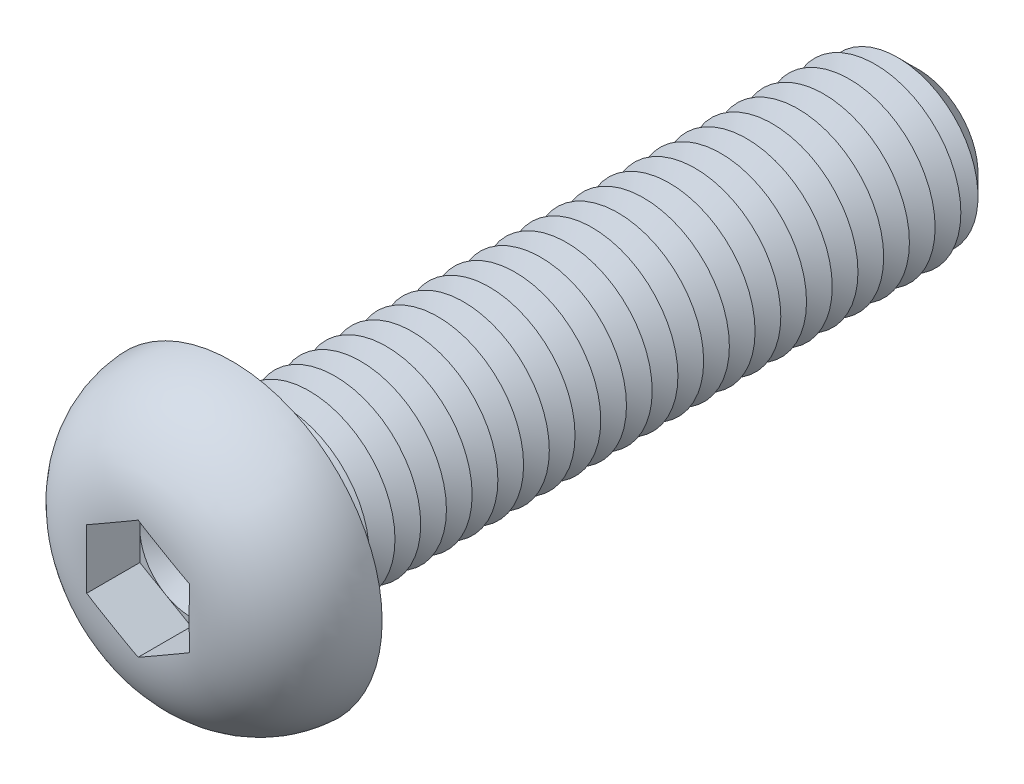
ISO-10303-21;
HEADER;
FILE_DESCRIPTION(('STEP AP214'),'2;1');
FILE_NAME('part.step','',(''),(''),'','','');
FILE_SCHEMA(('AUTOMOTIVE_DESIGN { 1 0 10303 214 1 1 1 1 }'));
ENDSEC;
DATA;
#1=APPLICATION_CONTEXT('core data for automotive mechanical design processes');
#2=APPLICATION_PROTOCOL_DEFINITION('international standard','automotive_design',2000,#1);
#3=PRODUCT_CONTEXT('',#1,'mechanical');
#4=PRODUCT('Part','Part','',(#3));
#5=PRODUCT_RELATED_PRODUCT_CATEGORY('part','',(#4));
#6=PRODUCT_DEFINITION_FORMATION('','',#4);
#7=PRODUCT_DEFINITION_CONTEXT('part definition',#1,'design');
#8=PRODUCT_DEFINITION('design','',#6,#7);
#9=PRODUCT_DEFINITION_SHAPE('','',#8);
#10=(LENGTH_UNIT() NAMED_UNIT(*) SI_UNIT(.MILLI.,.METRE.));
#11=(NAMED_UNIT(*) PLANE_ANGLE_UNIT() SI_UNIT($,.RADIAN.));
#12=(NAMED_UNIT(*) SI_UNIT($,.STERADIAN.) SOLID_ANGLE_UNIT());
#13=UNCERTAINTY_MEASURE_WITH_UNIT(LENGTH_MEASURE(1.E-05),#10,'distance_accuracy_value','');
#14=(GEOMETRIC_REPRESENTATION_CONTEXT(3) GLOBAL_UNCERTAINTY_ASSIGNED_CONTEXT((#13)) GLOBAL_UNIT_ASSIGNED_CONTEXT((#10,
#11,#12)) REPRESENTATION_CONTEXT('',''));
#15=CARTESIAN_POINT('',(0.,0.,0.));
#16=DIRECTION('',(0.,0.,1.));
#17=DIRECTION('',(1.,0.,0.));
#18=AXIS2_PLACEMENT_3D('',#15,#16,#17);
#19=CARTESIAN_POINT('',(0.,0.,2.38));
#20=DIRECTION('',(0.,0.,1.));
#21=DIRECTION('',(1.,0.,0.));
#22=AXIS2_PLACEMENT_3D('',#19,#20,#21);
#23=PLANE('',#22);
#24=CARTESIAN_POINT('',(0.,0.,2.38));
#25=DIRECTION('',(0.,0.,1.));
#26=DIRECTION('',(1.,0.,0.));
#27=AXIS2_PLACEMENT_3D('',#24,#25,#26);
#28=CIRCLE('',#27,3.);
#29=CARTESIAN_POINT('',(3.,0.,2.38));
#30=VERTEX_POINT('',#29);
#31=CARTESIAN_POINT('',(1.5,2.59807621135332,2.38));
#32=VERTEX_POINT('',#31);
#33=EDGE_CURVE('E117',#30,#32,#28,.T.);
#34=ORIENTED_EDGE('',*,*,#33,.F.);
#35=DIRECTION('',(0.,1.,0.));
#36=VECTOR('',#35,1.);
#37=CARTESIAN_POINT('',(3.,-1.73205080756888,2.38));
#38=LINE('',#37,#36);
#39=CARTESIAN_POINT('',(3.,1.73205080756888,2.38));
#40=VERTEX_POINT('',#39);
#41=EDGE_CURVE('E140',#30,#40,#38,.T.);
#42=ORIENTED_EDGE('',*,*,#41,.T.);
#43=DIRECTION('',(-0.866025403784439,0.5,0.));
#44=VECTOR('',#43,1.);
#45=CARTESIAN_POINT('',(3.,1.73205080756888,2.38));
#46=LINE('',#45,#44);
#47=EDGE_CURVE('E136',#40,#32,#46,.T.);
#48=ORIENTED_EDGE('',*,*,#47,.T.);
#49=EDGE_LOOP('',(#34,#42,#48));
#50=FACE_BOUND('',#49,.T.);
#51=ADVANCED_FACE('F39',(#50),#23,.T.);
#52=CARTESIAN_POINT('',(0.,0.,2.38));
#53=DIRECTION('',(0.,0.,1.));
#54=DIRECTION('',(1.,0.,0.));
#55=AXIS2_PLACEMENT_3D('',#52,#53,#54);
#56=CIRCLE('',#55,3.);
#57=CARTESIAN_POINT('',(-1.5,2.59807621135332,2.38));
#58=VERTEX_POINT('',#57);
#59=EDGE_CURVE('E11',#32,#58,#56,.T.);
#60=ORIENTED_EDGE('',*,*,#59,.F.);
#61=CARTESIAN_POINT('',(0.,3.46410161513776,2.38));
#62=VERTEX_POINT('',#61);
#63=EDGE_CURVE('E130',#32,#62,#46,.T.);
#64=ORIENTED_EDGE('',*,*,#63,.T.);
#65=DIRECTION('',(-0.866025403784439,-0.5,0.));
#66=VECTOR('',#65,1.);
#67=CARTESIAN_POINT('',(0.,3.46410161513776,2.38));
#68=LINE('',#67,#66);
#69=EDGE_CURVE('E131',#62,#58,#68,.T.);
#70=ORIENTED_EDGE('',*,*,#69,.T.);
#71=EDGE_LOOP('',(#60,#64,#70));
#72=FACE_BOUND('',#71,.T.);
#73=ADVANCED_FACE('F129',(#72),#23,.T.);
#74=CARTESIAN_POINT('',(-3.,0.,2.38));
#75=VERTEX_POINT('',#74);
#76=EDGE_CURVE('E49',#58,#75,#56,.T.);
#77=ORIENTED_EDGE('',*,*,#76,.F.);
#78=CARTESIAN_POINT('',(-3.,1.73205080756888,2.38));
#79=VERTEX_POINT('',#78);
#80=EDGE_CURVE('E143',#58,#79,#68,.T.);
#81=ORIENTED_EDGE('',*,*,#80,.T.);
#82=DIRECTION('',(0.,-1.,0.));
#83=VECTOR('',#82,1.);
#84=CARTESIAN_POINT('',(-3.,1.73205080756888,2.38));
#85=LINE('',#84,#83);
#86=EDGE_CURVE('E152',#79,#75,#85,.T.);
#87=ORIENTED_EDGE('',*,*,#86,.T.);
#88=EDGE_LOOP('',(#77,#81,#87));
#89=FACE_BOUND('',#88,.T.);
#90=ADVANCED_FACE('F275',(#89),#23,.T.);
#91=CARTESIAN_POINT('',(-1.5,-2.59807621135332,2.38));
#92=VERTEX_POINT('',#91);
#93=EDGE_CURVE('E259',#75,#92,#56,.T.);
#94=ORIENTED_EDGE('',*,*,#93,.F.);
#95=CARTESIAN_POINT('',(-3.,-1.73205080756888,2.38));
#96=VERTEX_POINT('',#95);
#97=EDGE_CURVE('E151',#75,#96,#85,.T.);
#98=ORIENTED_EDGE('',*,*,#97,.T.);
#99=DIRECTION('',(0.866025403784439,-0.5,0.));
#100=VECTOR('',#99,1.);
#101=CARTESIAN_POINT('',(-3.,-1.73205080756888,2.38));
#102=LINE('',#101,#100);
#103=EDGE_CURVE('E157',#96,#92,#102,.T.);
#104=ORIENTED_EDGE('',*,*,#103,.T.);
#105=EDGE_LOOP('',(#94,#98,#104));
#106=FACE_BOUND('',#105,.T.);
#107=ADVANCED_FACE('F269',(#106),#23,.T.);
#108=CARTESIAN_POINT('',(1.5,-2.59807621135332,2.38));
#109=VERTEX_POINT('',#108);
#110=EDGE_CURVE('E56',#92,#109,#56,.T.);
#111=ORIENTED_EDGE('',*,*,#110,.F.);
#112=CARTESIAN_POINT('',(0.,-3.46410161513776,2.38));
#113=VERTEX_POINT('',#112);
#114=EDGE_CURVE('E156',#92,#113,#102,.T.);
#115=ORIENTED_EDGE('',*,*,#114,.T.);
#116=DIRECTION('',(0.866025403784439,0.5,0.));
#117=VECTOR('',#116,1.);
#118=CARTESIAN_POINT('',(0.,-3.46410161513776,2.38));
#119=LINE('',#118,#117);
#120=EDGE_CURVE('E162',#113,#109,#119,.T.);
#121=ORIENTED_EDGE('',*,*,#120,.T.);
#122=EDGE_LOOP('',(#111,#115,#121));
#123=FACE_BOUND('',#122,.T.);
#124=ADVANCED_FACE('F312',(#123),#23,.T.);
#125=CARTESIAN_POINT('',(0.,0.,-40.));
#126=DIRECTION('',(0.,0.,1.));
#127=DIRECTION('',(1.,0.,0.));
#128=AXIS2_PLACEMENT_3D('',#125,#126,#127);
#129=CYLINDRICAL_SURFACE('',#128,5.);
#130=CARTESIAN_POINT('',(0.,0.,-0.600000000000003));
#131=DIRECTION('',(0.,0.,1.));
#132=DIRECTION('',(1.,0.,0.));
#133=AXIS2_PLACEMENT_3D('',#130,#131,#132);
#134=CIRCLE('',#133,5.);
#135=CARTESIAN_POINT('',(5.,0.,-0.600000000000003));
#136=VERTEX_POINT('',#135);
#137=EDGE_CURVE('E241',#136,#136,#134,.F.);
#138=ORIENTED_EDGE('',*,*,#137,.T.);
#139=EDGE_LOOP('',(#138));
#140=FACE_BOUND('',#139,.T.);
#141=CARTESIAN_POINT('',(0.,0.,-1.5));
#142=DIRECTION('',(0.,0.,1.));
#143=DIRECTION('',(1.,0.,0.));
#144=AXIS2_PLACEMENT_3D('',#141,#142,#143);
#145=CIRCLE('',#144,5.00000000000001);
#146=CARTESIAN_POINT('',(5.00000000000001,0.,-1.5));
#147=VERTEX_POINT('',#146);
#148=EDGE_CURVE('E138',#147,#147,#145,.T.);
#149=ORIENTED_EDGE('',*,*,#148,.T.);
#150=EDGE_LOOP('',(#149));
#151=FACE_BOUND('',#150,.T.);
#152=ADVANCED_FACE('F313',(#140,#151),#129,.T.);
#153=CARTESIAN_POINT('',(0.,8.75,0.));
#154=DIRECTION('',(0.,0.,1.));
#155=DIRECTION('',(1.,0.,0.));
#156=AXIS2_PLACEMENT_3D('',#153,#154,#155);
#157=PLANE('',#156);
#158=CARTESIAN_POINT('',(0.,0.,0.));
#159=DIRECTION('',(0.,0.,1.));
#160=DIRECTION('',(1.,0.,0.));
#161=AXIS2_PLACEMENT_3D('',#158,#159,#160);
#162=CIRCLE('',#161,5.6);
#163=CARTESIAN_POINT('',(5.6,0.,0.));
#164=VERTEX_POINT('',#163);
#165=EDGE_CURVE('E250',#164,#164,#162,.T.);
#166=ORIENTED_EDGE('',*,*,#165,.T.);
#167=EDGE_LOOP('',(#166));
#168=FACE_BOUND('',#167,.T.);
#169=CARTESIAN_POINT('',(0.,0.,0.));
#170=DIRECTION('',(0.,0.,1.));
#171=DIRECTION('',(1.,0.,0.));
#172=AXIS2_PLACEMENT_3D('',#169,#170,#171);
#173=CIRCLE('',#172,8.75);
#174=CARTESIAN_POINT('',(8.75,0.,0.));
#175=VERTEX_POINT('',#174);
#176=EDGE_CURVE('E173',#175,#175,#173,.T.);
#177=ORIENTED_EDGE('',*,*,#176,.F.);
#178=EDGE_LOOP('',(#177));
#179=FACE_BOUND('',#178,.T.);
#180=ADVANCED_FACE('F316',(#168,#179),#157,.F.);
#181=CARTESIAN_POINT('',(0.,0.,-0.3));
#182=DIRECTION('',(0.,0.,1.));
#183=DIRECTION('',(1.,0.,0.));
#184=AXIS2_PLACEMENT_3D('',#181,#182,#183);
#185=DEGENERATE_TOROIDAL_SURFACE('',#184,2.95776381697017,5.8,.T.);
#186=CARTESIAN_POINT('',(-3.0002,1.73193533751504,5.47784605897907));
#187=CARTESIAN_POINT('',(-2.87524340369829,1.80407906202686,5.4841525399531));
#188=CARTESIAN_POINT('',(-2.75023731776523,1.87625135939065,5.48853670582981));
#189=CARTESIAN_POINT('',(-2.5001955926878,2.02061301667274,5.49472046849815));
#190=CARTESIAN_POINT('',(-2.37515996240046,2.09280237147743,5.49652051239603));
#191=CARTESIAN_POINT('',(-2.12510741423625,2.23717027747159,5.4987972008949));
#192=CARTESIAN_POINT('',(-2.00009049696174,2.30934882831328,5.49927407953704));
#193=CARTESIAN_POINT('',(-1.75004905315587,2.45371032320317,5.49979859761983));
#194=CARTESIAN_POINT('',(-1.62502452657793,2.52589326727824,5.49984621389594));
#195=CARTESIAN_POINT('',(-1.37497547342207,2.67025915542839,5.49984621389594));
#196=CARTESIAN_POINT('',(-1.24995094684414,2.74244209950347,5.49979859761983));
#197=CARTESIAN_POINT('',(-0.999909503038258,2.88680359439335,5.49927407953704));
#198=CARTESIAN_POINT('',(-0.874892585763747,2.95898214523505,5.4987972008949));
#199=CARTESIAN_POINT('',(-0.624840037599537,3.10335005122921,5.49652051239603));
#200=CARTESIAN_POINT('',(-0.499804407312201,3.1755394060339,5.49472046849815));
#201=CARTESIAN_POINT('',(-0.249762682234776,3.31990106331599,5.48853670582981));
#202=CARTESIAN_POINT('',(-0.124756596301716,3.39207336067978,5.4841525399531));
#203=CARTESIAN_POINT('',(0.000199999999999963,3.46421708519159,5.47784605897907));
#204=B_SPLINE_CURVE_WITH_KNOTS('',3,(#186,#187,#188,#189,#190,#191,#192,#193,#194,#195,#196,
#197,#198,#199,#200,#201,#202,#203),.UNSPECIFIED.,.F.,.F.,(4,2,2,2,2,2,2,2,4),(0.,
0.433225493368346,0.866376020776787,1.29944992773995,1.73254720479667,2.16564448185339,
2.59871838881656,3.031868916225,3.46509440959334),.UNSPECIFIED.);
#205=CARTESIAN_POINT('',(-3.,1.73205080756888,5.4778561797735));
#206=VERTEX_POINT('',#205);
#207=CARTESIAN_POINT('',(0.,3.46410161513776,5.4778561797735));
#208=VERTEX_POINT('',#207);
#209=EDGE_CURVE('E195',#206,#208,#204,.T.);
#210=ORIENTED_EDGE('',*,*,#209,.T.);
#211=CARTESIAN_POINT('',(-0.000200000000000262,3.46421708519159,5.47784605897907));
#212=CARTESIAN_POINT('',(0.124756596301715,3.39207336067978,5.4841525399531));
#213=CARTESIAN_POINT('',(0.249762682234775,3.31990106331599,5.48853670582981));
#214=CARTESIAN_POINT('',(0.4998044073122,3.1755394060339,5.49472046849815));
#215=CARTESIAN_POINT('',(0.624840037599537,3.10335005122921,5.49652051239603));
#216=CARTESIAN_POINT('',(0.874892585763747,2.95898214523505,5.4987972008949));
#217=CARTESIAN_POINT('',(0.999909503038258,2.88680359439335,5.49927407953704));
#218=CARTESIAN_POINT('',(1.24995094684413,2.74244209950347,5.49979859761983));
#219=CARTESIAN_POINT('',(1.37497547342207,2.67025915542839,5.49984621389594));
#220=CARTESIAN_POINT('',(1.62502452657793,2.52589326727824,5.49984621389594));
#221=CARTESIAN_POINT('',(1.75004905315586,2.45371032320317,5.49979859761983));
#222=CARTESIAN_POINT('',(2.00009049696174,2.30934882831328,5.49927407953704));
#223=CARTESIAN_POINT('',(2.12510741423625,2.23717027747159,5.4987972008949));
#224=CARTESIAN_POINT('',(2.37515996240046,2.09280237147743,5.49652051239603));
#225=CARTESIAN_POINT('',(2.5001955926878,2.02061301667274,5.49472046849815));
#226=CARTESIAN_POINT('',(2.75023731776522,1.87625135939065,5.48853670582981));
#227=CARTESIAN_POINT('',(2.87524340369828,1.80407906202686,5.4841525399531));
#228=CARTESIAN_POINT('',(3.0002,1.73193533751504,5.47784605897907));
#229=B_SPLINE_CURVE_WITH_KNOTS('',3,(#211,#212,#213,#214,#215,#216,#217,#218,#219,#220,#221,
#222,#223,#224,#225,#226,#227,#228),.UNSPECIFIED.,.F.,.F.,(4,2,2,2,2,2,2,2,4),(0.,
0.433225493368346,0.866376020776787,1.29944992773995,1.73254720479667,2.16564448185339,
2.59871838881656,3.031868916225,3.46509440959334),.UNSPECIFIED.);
#230=CARTESIAN_POINT('',(3.,1.73205080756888,5.47785617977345));
#231=VERTEX_POINT('',#230);
#232=EDGE_CURVE('E224',#208,#231,#229,.T.);
#233=ORIENTED_EDGE('',*,*,#232,.T.);
#234=CARTESIAN_POINT('',(3.,0.,5.49984621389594));
#235=CARTESIAN_POINT('',(3.,-0.125570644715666,5.49984449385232));
#236=CARTESIAN_POINT('',(3.,-0.251141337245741,5.49980426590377));
#237=CARTESIAN_POINT('',(3.,-0.502283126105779,5.499449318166));
#238=CARTESIAN_POINT('',(3.,-0.62785422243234,5.49913459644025));
#239=CARTESIAN_POINT('',(3.,-0.879037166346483,5.49770394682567));
#240=CARTESIAN_POINT('',(3.,-1.00464901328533,5.49658774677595));
#241=CARTESIAN_POINT('',(3.,-1.2558477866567,5.49279605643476));
#242=CARTESIAN_POINT('',(3.,-1.38143471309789,5.49012056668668));
#243=CARTESIAN_POINT('',(3.,-1.7568847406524,5.47847778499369));
#244=CARTESIAN_POINT('',(3.,-2.00667103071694,5.46590367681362));
#245=CARTESIAN_POINT('',(3.,-2.50488375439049,5.42441448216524));
#246=CARTESIAN_POINT('',(3.,-2.75331093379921,5.3955095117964));
#247=CARTESIAN_POINT('',(3.,-3.18719021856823,5.32582626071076));
#248=CARTESIAN_POINT('',(3.,-3.3733635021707,5.28960049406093));
#249=CARTESIAN_POINT('',(3.,-3.74245496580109,5.20330651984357));
#250=CARTESIAN_POINT('',(3.,-3.92537417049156,5.15324275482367));
#251=CARTESIAN_POINT('',(3.,-4.28675502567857,5.03819885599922));
#252=CARTESIAN_POINT('',(3.,-4.46521058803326,4.97319946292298));
#253=CARTESIAN_POINT('',(3.,-4.81576789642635,4.82782766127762));
#254=CARTESIAN_POINT('',(3.,-4.98786985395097,4.74745576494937));
#255=CARTESIAN_POINT('',(3.,-5.3254008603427,4.5705398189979));
#256=CARTESIAN_POINT('',(3.,-5.49076268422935,4.47386710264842));
#257=CARTESIAN_POINT('',(3.,-5.81151175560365,4.26514040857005));
#258=CARTESIAN_POINT('',(3.,-5.96689840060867,4.15308550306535));
#259=CARTESIAN_POINT('',(3.,-6.26591787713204,3.91428862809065));
#260=CARTESIAN_POINT('',(3.,-6.40955257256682,3.78754899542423));
#261=CARTESIAN_POINT('',(3.,-6.68342295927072,3.52034797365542));
#262=CARTESIAN_POINT('',(3.,-6.81366070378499,3.3798886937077));
#263=CARTESIAN_POINT('',(3.,-7.0426666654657,3.10626157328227));
#264=CARTESIAN_POINT('',(3.,-7.1433109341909,2.97465879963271));
#265=CARTESIAN_POINT('',(3.,-7.33253056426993,2.70304716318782));
#266=CARTESIAN_POINT('',(3.,-7.42110686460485,2.56303895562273));
#267=CARTESIAN_POINT('',(3.,-7.58534868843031,2.27573732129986));
#268=CARTESIAN_POINT('',(3.,-7.66102067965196,2.12844759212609));
#269=CARTESIAN_POINT('',(3.,-7.79881901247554,1.82765987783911));
#270=CARTESIAN_POINT('',(3.,-7.86094563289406,1.67416202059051));
#271=CARTESIAN_POINT('',(3.,-7.96803488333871,1.37082076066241));
#272=CARTESIAN_POINT('',(3.,-8.01375687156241,1.22124490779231));
#273=CARTESIAN_POINT('',(3.,-8.09224398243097,0.918674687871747));
#274=CARTESIAN_POINT('',(3.,-8.12500479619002,0.765679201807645));
#275=CARTESIAN_POINT('',(3.,-8.17726457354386,0.457507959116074));
#276=CARTESIAN_POINT('',(3.,-8.1967692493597,0.302333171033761));
#277=CARTESIAN_POINT('',(3.,-8.22238322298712,-0.00917738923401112));
#278=CARTESIAN_POINT('',(3.,-8.22848754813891,-0.165513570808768));
#279=CARTESIAN_POINT('',(3.,-8.22724693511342,-0.475358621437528));
#280=CARTESIAN_POINT('',(3.,-8.2201384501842,-0.628868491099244));
#281=CARTESIAN_POINT('',(3.,-8.1929851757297,-0.934809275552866));
#282=CARTESIAN_POINT('',(3.,-8.17293462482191,-1.0872396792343));
#283=CARTESIAN_POINT('',(3.,-8.1200547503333,-1.38984943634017));
#284=CARTESIAN_POINT('',(3.,-8.08722683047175,-1.54002903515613));
#285=CARTESIAN_POINT('',(3.,-8.0090712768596,-1.83702738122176));
#286=CARTESIAN_POINT('',(3.,-7.96374919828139,-1.98384759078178));
#287=CARTESIAN_POINT('',(3.,-7.86096457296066,-2.27315566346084));
#288=CARTESIAN_POINT('',(3.,-7.80350334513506,-2.41564399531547));
#289=CARTESIAN_POINT('',(3.,-7.67691451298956,-2.6952770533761));
#290=CARTESIAN_POINT('',(3.,-7.60779108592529,-2.83242367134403));
#291=CARTESIAN_POINT('',(3.,-7.45837210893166,-3.10056990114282));
#292=CARTESIAN_POINT('',(3.,-7.37807144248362,-3.23156666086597));
#293=CARTESIAN_POINT('',(3.,-7.20697634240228,-3.48645411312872));
#294=CARTESIAN_POINT('',(3.,-7.11618520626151,-3.61034702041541));
#295=CARTESIAN_POINT('',(3.,-6.92334779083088,-3.85210954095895));
#296=CARTESIAN_POINT('',(3.,-6.82115263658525,-3.96986038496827));
#297=CARTESIAN_POINT('',(3.,-6.60745266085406,-4.19658717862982));
#298=CARTESIAN_POINT('',(3.,-6.49594754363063,-4.30556284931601));
#299=CARTESIAN_POINT('',(3.,-6.26450055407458,-4.51413072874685));
#300=CARTESIAN_POINT('',(3.,-6.14455919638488,-4.61372350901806));
#301=CARTESIAN_POINT('',(3.,-5.8971402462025,-4.80306090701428));
#302=CARTESIAN_POINT('',(3.,-5.76966228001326,-4.89280503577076));
#303=CARTESIAN_POINT('',(3.,-5.50268934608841,-5.06561354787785));
#304=CARTESIAN_POINT('',(3.,-5.36291526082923,-5.14824654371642));
#305=CARTESIAN_POINT('',(3.,-5.07726499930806,-5.30226841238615));
#306=CARTESIAN_POINT('',(3.,-4.93138704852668,-5.37365398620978));
#307=CARTESIAN_POINT('',(3.,-4.63484455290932,-5.50505544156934));
#308=CARTESIAN_POINT('',(3.,-4.48418671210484,-5.56508649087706));
#309=CARTESIAN_POINT('',(3.,-4.17906596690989,-5.6740700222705));
#310=CARTESIAN_POINT('',(3.,-4.02460600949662,-5.72303080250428));
#311=CARTESIAN_POINT('',(3.,-3.6739247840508,-5.82125760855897));
#312=CARTESIAN_POINT('',(3.,-3.47687521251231,-5.86756841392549));
#313=CARTESIAN_POINT('',(3.,-3.07981530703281,-5.94521593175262));
#314=CARTESIAN_POINT('',(3.,-2.87980357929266,-5.97654534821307));
#315=CARTESIAN_POINT('',(3.,-2.47751859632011,-6.02656554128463));
#316=CARTESIAN_POINT('',(3.,-2.27523974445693,-6.0452096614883));
#317=CARTESIAN_POINT('',(3.,-1.8700786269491,-6.07274849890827));
#318=CARTESIAN_POINT('',(3.,-1.66719636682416,-6.08164330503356));
#319=CARTESIAN_POINT('',(3.,-1.25887867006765,-6.09343726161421));
#320=CARTESIAN_POINT('',(3.,-1.05344157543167,-6.09626381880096));
#321=CARTESIAN_POINT('',(3.,-0.745285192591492,-6.0985660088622));
#322=CARTESIAN_POINT('',(3.,-0.642567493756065,-6.09901047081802));
#323=CARTESIAN_POINT('',(3.,-0.437131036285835,-6.09957976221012));
#324=CARTESIAN_POINT('',(3.,-0.334412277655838,-6.09970459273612));
#325=CARTESIAN_POINT('',(3.,-0.129132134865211,-6.09984385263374));
#326=CARTESIAN_POINT('',(3.,-0.0265707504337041,-6.09985845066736));
#327=CARTESIAN_POINT('',(3.,0.178552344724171,-6.09981980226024));
#328=CARTESIAN_POINT('',(3.,0.281114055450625,-6.09976655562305));
#329=CARTESIAN_POINT('',(3.,0.486235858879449,-6.09946703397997));
#330=CARTESIAN_POINT('',(3.,0.588795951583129,-6.0992207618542));
#331=CARTESIAN_POINT('',(3.,0.793913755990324,-6.09826017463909));
#332=CARTESIAN_POINT('',(3.,0.896471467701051,-6.097545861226));
#333=CARTESIAN_POINT('',(3.,1.11088851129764,-6.0951586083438));
#334=CARTESIAN_POINT('',(3.,1.22274716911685,-6.0934045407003));
#335=CARTESIAN_POINT('',(3.,1.44642575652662,-6.08829151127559));
#336=CARTESIAN_POINT('',(3.,1.55824568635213,-6.08493255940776));
#337=CARTESIAN_POINT('',(3.,1.89360474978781,-6.07150074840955));
#338=CARTESIAN_POINT('',(3.,2.11703989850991,-6.05807293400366));
#339=CARTESIAN_POINT('',(3.,2.56083256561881,-6.01778675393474));
#340=CARTESIAN_POINT('',(3.,2.78120000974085,-5.99104517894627));
#341=CARTESIAN_POINT('',(3.,3.2192866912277,-5.92065658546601));
#342=CARTESIAN_POINT('',(3.,3.43700630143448,-5.8770119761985));
#343=CARTESIAN_POINT('',(3.,3.82666678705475,-5.78060449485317));
#344=CARTESIAN_POINT('',(3.,3.99942726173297,-5.73116262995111));
#345=CARTESIAN_POINT('',(3.,4.3405567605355,-5.61888897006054));
#346=CARTESIAN_POINT('',(3.,4.50892617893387,-5.55605838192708));
#347=CARTESIAN_POINT('',(3.,4.84049143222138,-5.41635874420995));
#348=CARTESIAN_POINT('',(3.,5.00366586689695,-5.33943871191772));
#349=CARTESIAN_POINT('',(3.,5.32271829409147,-5.17167128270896));
#350=CARTESIAN_POINT('',(3.,5.47859600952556,-5.0808233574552));
#351=CARTESIAN_POINT('',(3.,5.7822829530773,-4.88500135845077));
#352=CARTESIAN_POINT('',(3.,5.93005015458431,-4.77996197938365));
#353=CARTESIAN_POINT('',(3.,6.21523046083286,-4.55663689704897));
#354=CARTESIAN_POINT('',(3.,6.35264336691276,-4.43835093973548));
#355=CARTESIAN_POINT('',(3.,6.61552762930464,-4.18948618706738));
#356=CARTESIAN_POINT('',(3.,6.74101380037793,-4.05892305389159));
#357=CARTESIAN_POINT('',(3.,6.97891308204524,-3.78639059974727));
#358=CARTESIAN_POINT('',(3.,7.09132750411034,-3.64442242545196));
#359=CARTESIAN_POINT('',(3.,7.29113623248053,-3.36530209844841));
#360=CARTESIAN_POINT('',(3.,7.37991316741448,-3.22913733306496));
#361=CARTESIAN_POINT('',(3.,7.5451968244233,-2.94955428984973));
#362=CARTESIAN_POINT('',(3.,7.62170419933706,-2.80613639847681));
#363=CARTESIAN_POINT('',(3.,7.76177641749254,-2.5131168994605));
#364=CARTESIAN_POINT('',(3.,7.82534152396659,-2.36351541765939));
#365=CARTESIAN_POINT('',(3.,7.93897019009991,-2.05926799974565));
#366=CARTESIAN_POINT('',(3.,7.98903395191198,-1.9046221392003));
#367=CARTESIAN_POINT('',(3.,8.07336540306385,-1.59821781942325));
#368=CARTESIAN_POINT('',(3.,8.10821878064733,-1.44662026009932));
#369=CARTESIAN_POINT('',(3.,8.16487862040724,-1.14095089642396));
#370=CARTESIAN_POINT('',(3.,8.18668070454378,-0.986878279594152));
#371=CARTESIAN_POINT('',(3.,8.21703234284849,-0.677515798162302));
#372=CARTESIAN_POINT('',(3.,8.22558889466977,-0.522226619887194));
#373=CARTESIAN_POINT('',(3.,8.22940229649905,-0.211427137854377));
#374=CARTESIAN_POINT('',(3.,8.22465425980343,-0.0559167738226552));
#375=CARTESIAN_POINT('',(3.,8.20204101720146,0.252033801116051));
#376=CARTESIAN_POINT('',(3.,8.18435378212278,0.404487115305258));
#377=CARTESIAN_POINT('',(3.,8.136196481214,0.707418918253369));
#378=CARTESIAN_POINT('',(3.,8.1057217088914,0.857896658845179));
#379=CARTESIAN_POINT('',(3.,8.03224632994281,1.15569567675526));
#380=CARTESIAN_POINT('',(3.,7.9892508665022,1.30301822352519));
#381=CARTESIAN_POINT('',(3.,7.89104818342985,1.59360769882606));
#382=CARTESIAN_POINT('',(3.,7.83583549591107,1.73687277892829));
#383=CARTESIAN_POINT('',(3.,7.71349498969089,2.01864020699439));
#384=CARTESIAN_POINT('',(3.,7.64633814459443,2.1571299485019));
#385=CARTESIAN_POINT('',(3.,7.50076383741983,2.42797950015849));
#386=CARTESIAN_POINT('',(3.,7.42235122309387,2.56034191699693));
#387=CARTESIAN_POINT('',(3.,7.25483284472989,2.8181715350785));
#388=CARTESIAN_POINT('',(3.,7.16572386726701,2.94363664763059));
#389=CARTESIAN_POINT('',(3.,6.9775559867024,3.1867979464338));
#390=CARTESIAN_POINT('',(3.,6.87850037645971,3.30449668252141));
#391=CARTESIAN_POINT('',(3.,6.66919743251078,3.53363644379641));
#392=CARTESIAN_POINT('',(3.,6.55877281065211,3.6449154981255));
#393=CARTESIAN_POINT('',(3.,6.32925753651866,3.85806320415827));
#394=CARTESIAN_POINT('',(3.,6.21016952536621,3.95993470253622));
#395=CARTESIAN_POINT('',(3.,5.96413069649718,4.15386505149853));
#396=CARTESIAN_POINT('',(3.,5.83717459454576,4.24591719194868));
#397=CARTESIAN_POINT('',(3.,5.5764653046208,4.41973423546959));
#398=CARTESIAN_POINT('',(3.,5.4427139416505,4.50150188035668));
#399=CARTESIAN_POINT('',(3.,5.16249709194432,4.65840017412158));
#400=CARTESIAN_POINT('',(3.,5.01573037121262,4.73299250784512));
#401=CARTESIAN_POINT('',(3.,4.71685583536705,4.87057528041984));
#402=CARTESIAN_POINT('',(3.,4.56474751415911,4.93356461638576));
#403=CARTESIAN_POINT('',(3.,4.25657035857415,5.04801407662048));
#404=CARTESIAN_POINT('',(3.,4.10050882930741,5.09949395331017));
#405=CARTESIAN_POINT('',(3.,3.78523286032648,5.19149003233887));
#406=CARTESIAN_POINT('',(3.,3.62601895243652,5.23200806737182));
#407=CARTESIAN_POINT('',(3.,3.32461902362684,5.29856444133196));
#408=CARTESIAN_POINT('',(3.,3.18268434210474,5.32575733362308));
#409=CARTESIAN_POINT('',(3.,2.89760844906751,5.3729307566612));
#410=CARTESIAN_POINT('',(3.,2.75446703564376,5.39291005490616));
#411=CARTESIAN_POINT('',(3.,2.46730946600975,5.42656527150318));
#412=CARTESIAN_POINT('',(3.,2.32329255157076,5.44023457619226));
#413=CARTESIAN_POINT('',(3.,2.03487642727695,5.46234228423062));
#414=CARTESIAN_POINT('',(3.,1.89047722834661,5.4707808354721));
#415=CARTESIAN_POINT('',(3.,1.60058090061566,5.48373897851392));
#416=CARTESIAN_POINT('',(3.,1.45508270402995,5.48823290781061));
#417=CARTESIAN_POINT('',(3.,1.16402671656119,5.49458098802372));
#418=CARTESIAN_POINT('',(3.,1.01846892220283,5.49643495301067));
#419=CARTESIAN_POINT('',(3.,0.72742451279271,5.49877506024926));
#420=CARTESIAN_POINT('',(3.,0.581937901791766,5.49926194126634));
#421=CARTESIAN_POINT('',(3.,0.290967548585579,5.49979850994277));
#422=CARTESIAN_POINT('',(3.,0.145483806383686,5.49984820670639));
#423=CARTESIAN_POINT('',(3.,0.,5.49984621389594));
#424=B_SPLINE_CURVE_WITH_KNOTS('',3,(#234,#235,#236,#237,#238,#239,#240,#241,#242,#243,#244,
#245,#246,#247,#248,#249,#250,#251,#252,#253,#254,#255,#256,#257,#258,#259,#260,#261,#262,#263,
#264,#265,#266,#267,#268,#269,#270,#271,#272,#273,#274,#275,#276,#277,#278,#279,#280,#281,#282,
#283,#284,#285,#286,#287,#288,#289,#290,#291,#292,#293,#294,#295,#296,#297,#298,#299,#300,#301,
#302,#303,#304,#305,#306,#307,#308,#309,#310,#311,#312,#313,#314,#315,#316,#317,#318,#319,#320,
#321,#322,#323,#324,#325,#326,#327,#328,#329,#330,#331,#332,#333,#334,#335,#336,#337,#338,#339,
#340,#341,#342,#343,#344,#345,#346,#347,#348,#349,#350,#351,#352,#353,#354,#355,#356,#357,#358,
#359,#360,#361,#362,#363,#364,#365,#366,#367,#368,#369,#370,#371,#372,#373,#374,#375,#376,#377,
#378,#379,#380,#381,#382,#383,#384,#385,#386,#387,#388,#389,#390,#391,#392,#393,#394,#395,#396,
#397,#398,#399,#400,#401,#402,#403,#404,#405,#406,#407,#408,#409,#410,#411,#412,#413,#414,#415,
#416,#417,#418,#419,#420,#421,#422,#423),.UNSPECIFIED.,.T.,.F.,(4,2,2,2,2,2,2,2,2,2,2,2,2,2,2,2,
2,2,2,2,2,2,2,2,2,2,2,2,2,2,2,2,2,2,2,2,2,2,2,2,2,2,2,2,2,2,2,2,2,2,2,2,2,2,2,2,2,2,2,2,2,2,2,2,
2,2,2,2,2,2,2,2,2,2,2,2,2,2,2,2,2,2,2,2,2,2,2,2,2,2,2,2,2,2,4),(0.,0.376711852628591,
0.753426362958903,1.13026885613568,1.50711121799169,2.257095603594,3.00661592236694,
3.57514719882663,4.14349616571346,4.71258216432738,5.28164920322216,5.85543852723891,
6.42926247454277,7.00299523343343,7.57663992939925,8.07303876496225,8.56939895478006,
9.06550962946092,9.56161009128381,10.030267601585,10.4990807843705,10.9676918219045,
11.4364767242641,11.8969530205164,12.3576344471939,12.8182652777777,13.2786916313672,
13.7390679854,14.1992797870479,14.6597029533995,15.1199817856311,15.5871904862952,
16.0544140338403,16.5216091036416,16.9888273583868,17.4754224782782,17.9621600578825,
18.4482427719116,18.9339599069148,19.5405320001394,20.1473991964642,20.7564865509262,
21.3655683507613,21.9818967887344,22.2900536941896,22.5982095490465,22.905893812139,
23.2135789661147,23.5212595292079,23.8289389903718,24.1645461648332,24.5001512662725,
25.171371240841,25.8368042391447,26.5021424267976,27.0407309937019,27.5792710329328,
28.119799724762,28.660348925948,29.2034761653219,29.7466138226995,30.2890677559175,
30.831467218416,31.3185063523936,31.8055195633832,32.2925228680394,32.779518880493,
33.2456153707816,33.7118681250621,34.1778744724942,34.6440520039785,35.103935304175,
35.563988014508,36.0238520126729,36.4839222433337,36.9451261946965,37.4061321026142,
37.8672768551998,38.3282694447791,38.7980460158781,39.2676799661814,39.7376328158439,
40.207460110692,40.7008436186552,41.1942739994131,41.6868509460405,42.1793454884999,
42.6126940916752,43.0461167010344,43.479992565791,43.9138561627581,44.3505218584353,
44.7872183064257,45.2236787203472,45.6601300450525),.UNSPECIFIED.);
#425=CARTESIAN_POINT('',(3.,-1.73205080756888,5.4778561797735));
#426=VERTEX_POINT('',#425);
#427=EDGE_CURVE('E233',#231,#426,#424,.T.);
#428=ORIENTED_EDGE('',*,*,#427,.T.);
#429=CARTESIAN_POINT('',(3.0002,-1.73193533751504,5.47784605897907));
#430=CARTESIAN_POINT('',(2.87524340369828,-1.80407906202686,5.4841525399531));
#431=CARTESIAN_POINT('',(2.75023731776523,-1.87625135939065,5.48853670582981));
#432=CARTESIAN_POINT('',(2.5001955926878,-2.02061301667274,5.49472046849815));
#433=CARTESIAN_POINT('',(2.37515996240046,-2.09280237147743,5.49652051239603));
#434=CARTESIAN_POINT('',(2.12510741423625,-2.23717027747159,5.4987972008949));
#435=CARTESIAN_POINT('',(2.00009049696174,-2.30934882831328,5.49927407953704));
#436=CARTESIAN_POINT('',(1.75004905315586,-2.45371032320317,5.49979859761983));
#437=CARTESIAN_POINT('',(1.62502452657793,-2.52589326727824,5.49984621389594));
#438=CARTESIAN_POINT('',(1.37497547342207,-2.67025915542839,5.49984621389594));
#439=CARTESIAN_POINT('',(1.24995094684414,-2.74244209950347,5.49979859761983));
#440=CARTESIAN_POINT('',(0.999909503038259,-2.88680359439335,5.49927407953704));
#441=CARTESIAN_POINT('',(0.874892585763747,-2.95898214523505,5.4987972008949));
#442=CARTESIAN_POINT('',(0.624840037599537,-3.10335005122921,5.49652051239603));
#443=CARTESIAN_POINT('',(0.499804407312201,-3.1755394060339,5.49472046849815));
#444=CARTESIAN_POINT('',(0.249762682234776,-3.31990106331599,5.48853670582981));
#445=CARTESIAN_POINT('',(0.124756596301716,-3.39207336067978,5.4841525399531));
#446=CARTESIAN_POINT('',(-0.000199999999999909,-3.46421708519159,5.47784605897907));
#447=B_SPLINE_CURVE_WITH_KNOTS('',3,(#429,#430,#431,#432,#433,#434,#435,#436,#437,#438,#439,
#440,#441,#442,#443,#444,#445,#446),.UNSPECIFIED.,.F.,.F.,(4,2,2,2,2,2,2,2,4),(0.,
0.433225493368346,0.866376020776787,1.29944992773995,1.73254720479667,2.16564448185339,
2.59871838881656,3.031868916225,3.46509440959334),.UNSPECIFIED.);
#448=CARTESIAN_POINT('',(0.,-3.46410161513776,5.4778561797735));
#449=VERTEX_POINT('',#448);
#450=EDGE_CURVE('E286',#426,#449,#447,.T.);
#451=ORIENTED_EDGE('',*,*,#450,.T.);
#452=CARTESIAN_POINT('',(0.000200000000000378,-3.46421708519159,5.47784605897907));
#453=CARTESIAN_POINT('',(-0.124756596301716,-3.39207336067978,5.4841525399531));
#454=CARTESIAN_POINT('',(-0.249762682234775,-3.31990106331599,5.48853670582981));
#455=CARTESIAN_POINT('',(-0.499804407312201,-3.1755394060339,5.49472046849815));
#456=CARTESIAN_POINT('',(-0.624840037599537,-3.10335005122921,5.49652051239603));
#457=CARTESIAN_POINT('',(-0.874892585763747,-2.95898214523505,5.4987972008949));
#458=CARTESIAN_POINT('',(-0.999909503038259,-2.88680359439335,5.49927407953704));
#459=CARTESIAN_POINT('',(-1.24995094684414,-2.74244209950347,5.49979859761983));
#460=CARTESIAN_POINT('',(-1.37497547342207,-2.67025915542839,5.49984621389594));
#461=CARTESIAN_POINT('',(-1.62502452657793,-2.52589326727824,5.49984621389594));
#462=CARTESIAN_POINT('',(-1.75004905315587,-2.45371032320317,5.49979859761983));
#463=CARTESIAN_POINT('',(-2.00009049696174,-2.30934882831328,5.49927407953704));
#464=CARTESIAN_POINT('',(-2.12510741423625,-2.23717027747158,5.4987972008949));
#465=CARTESIAN_POINT('',(-2.37515996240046,-2.09280237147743,5.49652051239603));
#466=CARTESIAN_POINT('',(-2.5001955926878,-2.02061301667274,5.49472046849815));
#467=CARTESIAN_POINT('',(-2.75023731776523,-1.87625135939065,5.48853670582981));
#468=CARTESIAN_POINT('',(-2.87524340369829,-1.80407906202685,5.4841525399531));
#469=CARTESIAN_POINT('',(-3.0002,-1.73193533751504,5.47784605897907));
#470=B_SPLINE_CURVE_WITH_KNOTS('',3,(#452,#453,#454,#455,#456,#457,#458,#459,#460,#461,#462,
#463,#464,#465,#466,#467,#468,#469),.UNSPECIFIED.,.F.,.F.,(4,2,2,2,2,2,2,2,4),(0.,
0.433225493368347,0.866376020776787,1.29944992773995,1.73254720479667,2.16564448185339,
2.59871838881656,3.031868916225,3.46509440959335),.UNSPECIFIED.);
#471=CARTESIAN_POINT('',(-3.,-1.73205080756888,5.47785617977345));
#472=VERTEX_POINT('',#471);
#473=EDGE_CURVE('E282',#449,#472,#470,.T.);
#474=ORIENTED_EDGE('',*,*,#473,.T.);
#475=CARTESIAN_POINT('',(-3.,0.,5.49984621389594));
#476=CARTESIAN_POINT('',(-3.,0.125570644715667,5.49984449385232));
#477=CARTESIAN_POINT('',(-3.,0.251141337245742,5.49980426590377));
#478=CARTESIAN_POINT('',(-3.,0.50228312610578,5.499449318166));
#479=CARTESIAN_POINT('',(-3.,0.627854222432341,5.49913459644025));
#480=CARTESIAN_POINT('',(-3.,0.879037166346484,5.49770394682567));
#481=CARTESIAN_POINT('',(-3.,1.00464901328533,5.49658774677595));
#482=CARTESIAN_POINT('',(-3.,1.2558477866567,5.49279605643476));
#483=CARTESIAN_POINT('',(-3.,1.3814347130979,5.49012056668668));
#484=CARTESIAN_POINT('',(-3.,1.7568847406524,5.47847778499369));
#485=CARTESIAN_POINT('',(-3.,2.00667103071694,5.46590367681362));
#486=CARTESIAN_POINT('',(-3.,2.50488375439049,5.42441448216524));
#487=CARTESIAN_POINT('',(-3.,2.75331093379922,5.3955095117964));
#488=CARTESIAN_POINT('',(-3.,3.18719021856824,5.32582626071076));
#489=CARTESIAN_POINT('',(-3.,3.3733635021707,5.28960049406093));
#490=CARTESIAN_POINT('',(-3.,3.74245496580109,5.20330651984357));
#491=CARTESIAN_POINT('',(-3.,3.92537417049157,5.15324275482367));
#492=CARTESIAN_POINT('',(-3.,4.28675502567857,5.03819885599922));
#493=CARTESIAN_POINT('',(-3.,4.46521058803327,4.97319946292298));
#494=CARTESIAN_POINT('',(-3.,4.81576789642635,4.82782766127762));
#495=CARTESIAN_POINT('',(-3.,4.98786985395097,4.74745576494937));
#496=CARTESIAN_POINT('',(-3.,5.3254008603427,4.5705398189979));
#497=CARTESIAN_POINT('',(-3.,5.49076268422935,4.47386710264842));
#498=CARTESIAN_POINT('',(-3.,5.81151175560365,4.26514040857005));
#499=CARTESIAN_POINT('',(-3.,5.96689840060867,4.15308550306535));
#500=CARTESIAN_POINT('',(-3.,6.26591787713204,3.91428862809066));
#501=CARTESIAN_POINT('',(-3.,6.40955257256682,3.78754899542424));
#502=CARTESIAN_POINT('',(-3.,6.68342295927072,3.52034797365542));
#503=CARTESIAN_POINT('',(-3.,6.81366070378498,3.3798886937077));
#504=CARTESIAN_POINT('',(-3.,7.0426666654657,3.10626157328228));
#505=CARTESIAN_POINT('',(-3.,7.14331093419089,2.97465879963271));
#506=CARTESIAN_POINT('',(-3.,7.33253056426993,2.70304716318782));
#507=CARTESIAN_POINT('',(-3.,7.42110686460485,2.56303895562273));
#508=CARTESIAN_POINT('',(-3.,7.58534868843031,2.27573732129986));
#509=CARTESIAN_POINT('',(-3.,7.66102067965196,2.12844759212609));
#510=CARTESIAN_POINT('',(-3.,7.79881901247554,1.82765987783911));
#511=CARTESIAN_POINT('',(-3.,7.86094563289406,1.67416202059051));
#512=CARTESIAN_POINT('',(-3.,7.96803488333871,1.37082076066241));
#513=CARTESIAN_POINT('',(-3.,8.01375687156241,1.22124490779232));
#514=CARTESIAN_POINT('',(-3.,8.09224398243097,0.918674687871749));
#515=CARTESIAN_POINT('',(-3.,8.12500479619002,0.765679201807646));
#516=CARTESIAN_POINT('',(-3.,8.17726457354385,0.457507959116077));
#517=CARTESIAN_POINT('',(-3.,8.1967692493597,0.302333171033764));
#518=CARTESIAN_POINT('',(-3.,8.22238322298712,-0.00917738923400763));
#519=CARTESIAN_POINT('',(-3.,8.22848754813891,-0.165513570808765));
#520=CARTESIAN_POINT('',(-3.,8.22724693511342,-0.475358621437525));
#521=CARTESIAN_POINT('',(-3.,8.2201384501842,-0.628868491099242));
#522=CARTESIAN_POINT('',(-3.,8.1929851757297,-0.934809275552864));
#523=CARTESIAN_POINT('',(-3.,8.17293462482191,-1.08723967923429));
#524=CARTESIAN_POINT('',(-3.,8.1200547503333,-1.38984943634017));
#525=CARTESIAN_POINT('',(-3.,8.08722683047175,-1.54002903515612));
#526=CARTESIAN_POINT('',(-3.,8.0090712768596,-1.83702738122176));
#527=CARTESIAN_POINT('',(-3.,7.96374919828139,-1.98384759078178));
#528=CARTESIAN_POINT('',(-3.,7.86096457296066,-2.27315566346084));
#529=CARTESIAN_POINT('',(-3.,7.80350334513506,-2.41564399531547));
#530=CARTESIAN_POINT('',(-3.,7.67691451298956,-2.69527705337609));
#531=CARTESIAN_POINT('',(-3.,7.60779108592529,-2.83242367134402));
#532=CARTESIAN_POINT('',(-3.,7.45837210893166,-3.10056990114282));
#533=CARTESIAN_POINT('',(-3.,7.37807144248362,-3.23156666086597));
#534=CARTESIAN_POINT('',(-3.,7.20697634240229,-3.48645411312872));
#535=CARTESIAN_POINT('',(-3.,7.11618520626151,-3.61034702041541));
#536=CARTESIAN_POINT('',(-3.,6.92334779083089,-3.85210954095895));
#537=CARTESIAN_POINT('',(-3.,6.82115263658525,-3.96986038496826));
#538=CARTESIAN_POINT('',(-3.,6.60745266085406,-4.19658717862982));
#539=CARTESIAN_POINT('',(-3.,6.49594754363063,-4.30556284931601));
#540=CARTESIAN_POINT('',(-3.,6.26450055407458,-4.51413072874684));
#541=CARTESIAN_POINT('',(-3.,6.14455919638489,-4.61372350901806));
#542=CARTESIAN_POINT('',(-3.,5.8971402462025,-4.80306090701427));
#543=CARTESIAN_POINT('',(-3.,5.76966228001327,-4.89280503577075));
#544=CARTESIAN_POINT('',(-3.,5.50268934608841,-5.06561354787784));
#545=CARTESIAN_POINT('',(-3.,5.36291526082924,-5.14824654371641));
#546=CARTESIAN_POINT('',(-3.,5.07726499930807,-5.30226841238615));
#547=CARTESIAN_POINT('',(-3.,4.93138704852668,-5.37365398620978));
#548=CARTESIAN_POINT('',(-3.,4.63484455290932,-5.50505544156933));
#549=CARTESIAN_POINT('',(-3.,4.48418671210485,-5.56508649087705));
#550=CARTESIAN_POINT('',(-3.,4.17906596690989,-5.6740700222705));
#551=CARTESIAN_POINT('',(-3.,4.02460600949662,-5.72303080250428));
#552=CARTESIAN_POINT('',(-3.,3.6739247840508,-5.82125760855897));
#553=CARTESIAN_POINT('',(-3.,3.47687521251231,-5.86756841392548));
#554=CARTESIAN_POINT('',(-3.,3.07981530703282,-5.94521593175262));
#555=CARTESIAN_POINT('',(-3.,2.87980357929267,-5.97654534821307));
#556=CARTESIAN_POINT('',(-3.,2.47751859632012,-6.02656554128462));
#557=CARTESIAN_POINT('',(-3.,2.27523974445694,-6.0452096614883));
#558=CARTESIAN_POINT('',(-3.,1.87007862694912,-6.07274849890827));
#559=CARTESIAN_POINT('',(-3.,1.66719636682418,-6.08164330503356));
#560=CARTESIAN_POINT('',(-3.,1.25887867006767,-6.09343726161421));
#561=CARTESIAN_POINT('',(-3.,1.05344157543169,-6.09626381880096));
#562=CARTESIAN_POINT('',(-3.,0.745285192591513,-6.0985660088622));
#563=CARTESIAN_POINT('',(-3.,0.642567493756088,-6.09901047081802));
#564=CARTESIAN_POINT('',(-3.,0.437131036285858,-6.09957976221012));
#565=CARTESIAN_POINT('',(-3.,0.334412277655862,-6.09970459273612));
#566=CARTESIAN_POINT('',(-3.,0.129132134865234,-6.09984385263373));
#567=CARTESIAN_POINT('',(-3.,0.0265707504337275,-6.09985845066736));
#568=CARTESIAN_POINT('',(-3.,-0.178552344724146,-6.09981980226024));
#569=CARTESIAN_POINT('',(-3.,-0.281114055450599,-6.09976655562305));
#570=CARTESIAN_POINT('',(-3.,-0.486235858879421,-6.09946703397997));
#571=CARTESIAN_POINT('',(-3.,-0.588795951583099,-6.0992207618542));
#572=CARTESIAN_POINT('',(-3.,-0.793913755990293,-6.09826017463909));
#573=CARTESIAN_POINT('',(-3.,-0.89647146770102,-6.097545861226));
#574=CARTESIAN_POINT('',(-3.,-1.11088851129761,-6.0951586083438));
#575=CARTESIAN_POINT('',(-3.,-1.22274716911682,-6.0934045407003));
#576=CARTESIAN_POINT('',(-3.,-1.44642575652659,-6.08829151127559));
#577=CARTESIAN_POINT('',(-3.,-1.55824568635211,-6.08493255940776));
#578=CARTESIAN_POINT('',(-3.,-1.89360474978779,-6.07150074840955));
#579=CARTESIAN_POINT('',(-3.,-2.11703989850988,-6.05807293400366));
#580=CARTESIAN_POINT('',(-3.,-2.56083256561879,-6.01778675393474));
#581=CARTESIAN_POINT('',(-3.,-2.78120000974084,-5.99104517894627));
#582=CARTESIAN_POINT('',(-3.,-3.21928669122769,-5.92065658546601));
#583=CARTESIAN_POINT('',(-3.,-3.43700630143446,-5.8770119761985));
#584=CARTESIAN_POINT('',(-3.,-3.82666678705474,-5.78060449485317));
#585=CARTESIAN_POINT('',(-3.,-3.99942726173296,-5.73116262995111));
#586=CARTESIAN_POINT('',(-3.,-4.34055676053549,-5.61888897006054));
#587=CARTESIAN_POINT('',(-3.,-4.50892617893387,-5.55605838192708));
#588=CARTESIAN_POINT('',(-3.,-4.84049143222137,-5.41635874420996));
#589=CARTESIAN_POINT('',(-3.,-5.00366586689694,-5.33943871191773));
#590=CARTESIAN_POINT('',(-3.,-5.32271829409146,-5.17167128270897));
#591=CARTESIAN_POINT('',(-3.,-5.47859600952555,-5.08082335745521));
#592=CARTESIAN_POINT('',(-3.,-5.78228295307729,-4.88500135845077));
#593=CARTESIAN_POINT('',(-3.,-5.9300501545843,-4.77996197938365));
#594=CARTESIAN_POINT('',(-3.,-6.21523046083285,-4.55663689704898));
#595=CARTESIAN_POINT('',(-3.,-6.35264336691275,-4.43835093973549));
#596=CARTESIAN_POINT('',(-3.,-6.61552762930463,-4.18948618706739));
#597=CARTESIAN_POINT('',(-3.,-6.74101380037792,-4.05892305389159));
#598=CARTESIAN_POINT('',(-3.,-6.97891308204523,-3.78639059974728));
#599=CARTESIAN_POINT('',(-3.,-7.09132750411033,-3.64442242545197));
#600=CARTESIAN_POINT('',(-3.,-7.29113623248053,-3.36530209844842));
#601=CARTESIAN_POINT('',(-3.,-7.37991316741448,-3.22913733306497));
#602=CARTESIAN_POINT('',(-3.,-7.54519682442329,-2.94955428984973));
#603=CARTESIAN_POINT('',(-3.,-7.62170419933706,-2.80613639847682));
#604=CARTESIAN_POINT('',(-3.,-7.76177641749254,-2.5131168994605));
#605=CARTESIAN_POINT('',(-3.,-7.82534152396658,-2.3635154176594));
#606=CARTESIAN_POINT('',(-3.,-7.93897019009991,-2.05926799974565));
#607=CARTESIAN_POINT('',(-3.,-7.98903395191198,-1.9046221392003));
#608=CARTESIAN_POINT('',(-3.,-8.07336540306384,-1.59821781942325));
#609=CARTESIAN_POINT('',(-3.,-8.10821878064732,-1.44662026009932));
#610=CARTESIAN_POINT('',(-3.,-8.16487862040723,-1.14095089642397));
#611=CARTESIAN_POINT('',(-3.,-8.18668070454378,-0.986878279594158));
#612=CARTESIAN_POINT('',(-3.,-8.21703234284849,-0.677515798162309));
#613=CARTESIAN_POINT('',(-3.,-8.22558889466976,-0.522226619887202));
#614=CARTESIAN_POINT('',(-3.,-8.22940229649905,-0.211427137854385));
#615=CARTESIAN_POINT('',(-3.,-8.22465425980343,-0.0559167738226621));
#616=CARTESIAN_POINT('',(-3.,-8.20204101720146,0.252033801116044));
#617=CARTESIAN_POINT('',(-3.,-8.18435378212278,0.40448711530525));
#618=CARTESIAN_POINT('',(-3.,-8.136196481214,0.707418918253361));
#619=CARTESIAN_POINT('',(-3.,-8.1057217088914,0.857896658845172));
#620=CARTESIAN_POINT('',(-3.,-8.03224632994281,1.15569567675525));
#621=CARTESIAN_POINT('',(-3.,-7.9892508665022,1.30301822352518));
#622=CARTESIAN_POINT('',(-3.,-7.89104818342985,1.59360769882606));
#623=CARTESIAN_POINT('',(-3.,-7.83583549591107,1.73687277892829));
#624=CARTESIAN_POINT('',(-3.,-7.71349498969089,2.01864020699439));
#625=CARTESIAN_POINT('',(-3.,-7.64633814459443,2.1571299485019));
#626=CARTESIAN_POINT('',(-3.,-7.50076383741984,2.42797950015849));
#627=CARTESIAN_POINT('',(-3.,-7.42235122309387,2.56034191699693));
#628=CARTESIAN_POINT('',(-3.,-7.25483284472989,2.81817153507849));
#629=CARTESIAN_POINT('',(-3.,-7.16572386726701,2.94363664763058));
#630=CARTESIAN_POINT('',(-3.,-6.97755598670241,3.1867979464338));
#631=CARTESIAN_POINT('',(-3.,-6.87850037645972,3.30449668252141));
#632=CARTESIAN_POINT('',(-3.,-6.66919743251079,3.53363644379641));
#633=CARTESIAN_POINT('',(-3.,-6.55877281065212,3.64491549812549));
#634=CARTESIAN_POINT('',(-3.,-6.32925753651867,3.85806320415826));
#635=CARTESIAN_POINT('',(-3.,-6.21016952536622,3.95993470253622));
#636=CARTESIAN_POINT('',(-3.,-5.96413069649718,4.15386505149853));
#637=CARTESIAN_POINT('',(-3.,-5.83717459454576,4.24591719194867));
#638=CARTESIAN_POINT('',(-3.,-5.5764653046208,4.41973423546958));
#639=CARTESIAN_POINT('',(-3.,-5.4427139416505,4.50150188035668));
#640=CARTESIAN_POINT('',(-3.,-5.16249709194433,4.65840017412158));
#641=CARTESIAN_POINT('',(-3.,-5.01573037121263,4.73299250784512));
#642=CARTESIAN_POINT('',(-3.,-4.71685583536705,4.87057528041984));
#643=CARTESIAN_POINT('',(-3.,-4.56474751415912,4.93356461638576));
#644=CARTESIAN_POINT('',(-3.,-4.25657035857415,5.04801407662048));
#645=CARTESIAN_POINT('',(-3.,-4.10050882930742,5.09949395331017));
#646=CARTESIAN_POINT('',(-3.,-3.78523286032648,5.19149003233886));
#647=CARTESIAN_POINT('',(-3.,-3.62601895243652,5.23200806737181));
#648=CARTESIAN_POINT('',(-3.,-3.32461902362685,5.29856444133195));
#649=CARTESIAN_POINT('',(-3.,-3.18268434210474,5.32575733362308));
#650=CARTESIAN_POINT('',(-3.,-2.89760844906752,5.3729307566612));
#651=CARTESIAN_POINT('',(-3.,-2.75446703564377,5.39291005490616));
#652=CARTESIAN_POINT('',(-3.,-2.46730946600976,5.42656527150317));
#653=CARTESIAN_POINT('',(-3.,-2.32329255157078,5.44023457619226));
#654=CARTESIAN_POINT('',(-3.,-2.03487642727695,5.46234228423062));
#655=CARTESIAN_POINT('',(-3.,-1.89047722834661,5.4707808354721));
#656=CARTESIAN_POINT('',(-3.,-1.60058090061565,5.48373897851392));
#657=CARTESIAN_POINT('',(-3.,-1.45508270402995,5.48823290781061));
#658=CARTESIAN_POINT('',(-3.,-1.16402671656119,5.49458098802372));
#659=CARTESIAN_POINT('',(-3.,-1.01846892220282,5.49643495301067));
#660=CARTESIAN_POINT('',(-3.,-0.727424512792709,5.49877506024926));
#661=CARTESIAN_POINT('',(-3.,-0.581937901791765,5.49926194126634));
#662=CARTESIAN_POINT('',(-3.,-0.290967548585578,5.49979850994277));
#663=CARTESIAN_POINT('',(-3.,-0.145483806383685,5.49984820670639));
#664=CARTESIAN_POINT('',(-3.,0.,5.49984621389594));
#665=B_SPLINE_CURVE_WITH_KNOTS('',3,(#475,#476,#477,#478,#479,#480,#481,#482,#483,#484,#485,
#486,#487,#488,#489,#490,#491,#492,#493,#494,#495,#496,#497,#498,#499,#500,#501,#502,#503,#504,
#505,#506,#507,#508,#509,#510,#511,#512,#513,#514,#515,#516,#517,#518,#519,#520,#521,#522,#523,
#524,#525,#526,#527,#528,#529,#530,#531,#532,#533,#534,#535,#536,#537,#538,#539,#540,#541,#542,
#543,#544,#545,#546,#547,#548,#549,#550,#551,#552,#553,#554,#555,#556,#557,#558,#559,#560,#561,
#562,#563,#564,#565,#566,#567,#568,#569,#570,#571,#572,#573,#574,#575,#576,#577,#578,#579,#580,
#581,#582,#583,#584,#585,#586,#587,#588,#589,#590,#591,#592,#593,#594,#595,#596,#597,#598,#599,
#600,#601,#602,#603,#604,#605,#606,#607,#608,#609,#610,#611,#612,#613,#614,#615,#616,#617,#618,
#619,#620,#621,#622,#623,#624,#625,#626,#627,#628,#629,#630,#631,#632,#633,#634,#635,#636,#637,
#638,#639,#640,#641,#642,#643,#644,#645,#646,#647,#648,#649,#650,#651,#652,#653,#654,#655,#656,
#657,#658,#659,#660,#661,#662,#663,#664),.UNSPECIFIED.,.T.,.F.,(4,2,2,2,2,2,2,2,2,2,2,2,2,2,2,2,
2,2,2,2,2,2,2,2,2,2,2,2,2,2,2,2,2,2,2,2,2,2,2,2,2,2,2,2,2,2,2,2,2,2,2,2,2,2,2,2,2,2,2,2,2,2,2,2,
2,2,2,2,2,2,2,2,2,2,2,2,2,2,2,2,2,2,2,2,2,2,2,2,2,2,2,2,2,2,4),(0.,0.376711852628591,
0.753426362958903,1.13026885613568,1.50711121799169,2.257095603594,3.00661592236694,
3.57514719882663,4.14349616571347,4.71258216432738,5.28164920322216,5.85543852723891,
6.42926247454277,7.00299523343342,7.57663992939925,8.07303876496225,8.56939895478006,
9.06550962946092,9.56161009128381,10.030267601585,10.4990807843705,10.9676918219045,
11.4364767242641,11.8969530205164,12.3576344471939,12.8182652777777,13.2786916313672,
13.7390679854,14.1992797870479,14.6597029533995,15.1199817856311,15.5871904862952,
16.0544140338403,16.5216091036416,16.9888273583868,17.4754224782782,17.9621600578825,
18.4482427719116,18.9339599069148,19.5405320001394,20.1473991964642,20.7564865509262,
21.3655683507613,21.9818967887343,22.2900536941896,22.5982095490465,22.905893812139,
23.2135789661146,23.5212595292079,23.8289389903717,24.1645461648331,24.5001512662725,
25.171371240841,25.8368042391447,26.5021424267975,27.0407309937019,27.5792710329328,
28.1197997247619,28.6603489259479,29.2034761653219,29.7466138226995,30.2890677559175,
30.831467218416,31.3185063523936,31.8055195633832,32.2925228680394,32.779518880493,
33.2456153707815,33.711868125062,34.1778744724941,34.6440520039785,35.103935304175,
35.563988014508,36.0238520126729,36.4839222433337,36.9451261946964,37.4061321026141,
37.8672768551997,38.3282694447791,38.798046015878,39.2676799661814,39.7376328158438,
40.207460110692,40.7008436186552,41.194273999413,41.6868509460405,42.1793454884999,
42.6126940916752,43.0461167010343,43.479992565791,43.913856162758,44.3505218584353,
44.7872183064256,45.2236787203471,45.6601300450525),.UNSPECIFIED.);
#666=EDGE_CURVE('E204',#472,#206,#665,.T.);
#667=ORIENTED_EDGE('',*,*,#666,.T.);
#668=EDGE_LOOP('',(#210,#233,#428,#451,#474,#667));
#669=FACE_BOUND('',#668,.T.);
#670=ORIENTED_EDGE('',*,*,#176,.T.);
#671=EDGE_LOOP('',(#670));
#672=FACE_BOUND('',#671,.T.);
#673=ADVANCED_FACE('F209',(#669,#672),#185,.T.);
#674=CARTESIAN_POINT('',(3.,1.73205080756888,2.38));
#675=DIRECTION('',(0.5,0.866025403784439,0.));
#676=DIRECTION('',(-0.866025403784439,0.5,0.));
#677=AXIS2_PLACEMENT_3D('',#674,#675,#676);
#678=PLANE('',#677);
#679=DIRECTION('',(0.,0.,1.));
#680=VECTOR('',#679,1.);
#681=CARTESIAN_POINT('',(0.,3.46410161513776,2.38));
#682=LINE('',#681,#680);
#683=EDGE_CURVE('E64',#62,#208,#682,.T.);
#684=ORIENTED_EDGE('',*,*,#683,.F.);
#685=ORIENTED_EDGE('',*,*,#63,.F.);
#686=ORIENTED_EDGE('',*,*,#47,.F.);
#687=DIRECTION('',(0.,0.,1.));
#688=VECTOR('',#687,1.);
#689=CARTESIAN_POINT('',(3.,1.73205080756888,2.38));
#690=LINE('',#689,#688);
#691=EDGE_CURVE('E170',#40,#231,#690,.T.);
#692=ORIENTED_EDGE('',*,*,#691,.T.);
#693=ORIENTED_EDGE('',*,*,#232,.F.);
#694=EDGE_LOOP('',(#684,#685,#686,#692,#693));
#695=FACE_BOUND('',#694,.T.);
#696=ADVANCED_FACE('F134',(#695),#678,.F.);
#697=CARTESIAN_POINT('',(3.,-1.73205080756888,2.38));
#698=DIRECTION('',(1.,0.,0.));
#699=DIRECTION('',(0.,1.,0.));
#700=AXIS2_PLACEMENT_3D('',#697,#698,#699);
#701=PLANE('',#700);
#702=ORIENTED_EDGE('',*,*,#691,.F.);
#703=ORIENTED_EDGE('',*,*,#41,.F.);
#704=CARTESIAN_POINT('',(3.,-1.73205080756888,2.38));
#705=VERTEX_POINT('',#704);
#706=EDGE_CURVE('E166',#705,#30,#38,.T.);
#707=ORIENTED_EDGE('',*,*,#706,.F.);
#708=DIRECTION('',(0.,0.,1.));
#709=VECTOR('',#708,1.);
#710=CARTESIAN_POINT('',(3.,-1.73205080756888,2.38));
#711=LINE('',#710,#709);
#712=EDGE_CURVE('E174',#705,#426,#711,.T.);
#713=ORIENTED_EDGE('',*,*,#712,.T.);
#714=ORIENTED_EDGE('',*,*,#427,.F.);
#715=EDGE_LOOP('',(#702,#703,#707,#713,#714));
#716=FACE_BOUND('',#715,.T.);
#717=ADVANCED_FACE('F222',(#716),#701,.F.);
#718=CARTESIAN_POINT('',(0.,-3.46410161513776,2.38));
#719=DIRECTION('',(0.5,-0.866025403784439,0.));
#720=DIRECTION('',(0.866025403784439,0.5,0.));
#721=AXIS2_PLACEMENT_3D('',#718,#719,#720);
#722=PLANE('',#721);
#723=ORIENTED_EDGE('',*,*,#712,.F.);
#724=EDGE_CURVE('E161',#109,#705,#119,.T.);
#725=ORIENTED_EDGE('',*,*,#724,.F.);
#726=ORIENTED_EDGE('',*,*,#120,.F.);
#727=DIRECTION('',(0.,0.,1.));
#728=VECTOR('',#727,1.);
#729=CARTESIAN_POINT('',(0.,-3.46410161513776,2.38));
#730=LINE('',#729,#728);
#731=EDGE_CURVE('E178',#113,#449,#730,.T.);
#732=ORIENTED_EDGE('',*,*,#731,.T.);
#733=ORIENTED_EDGE('',*,*,#450,.F.);
#734=EDGE_LOOP('',(#723,#725,#726,#732,#733));
#735=FACE_BOUND('',#734,.T.);
#736=ADVANCED_FACE('F299',(#735),#722,.F.);
#737=CARTESIAN_POINT('',(-3.,-1.73205080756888,2.38));
#738=DIRECTION('',(-0.5,-0.866025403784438,0.));
#739=DIRECTION('',(0.866025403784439,-0.5,0.));
#740=AXIS2_PLACEMENT_3D('',#737,#738,#739);
#741=PLANE('',#740);
#742=ORIENTED_EDGE('',*,*,#731,.F.);
#743=ORIENTED_EDGE('',*,*,#114,.F.);
#744=ORIENTED_EDGE('',*,*,#103,.F.);
#745=DIRECTION('',(0.,0.,1.));
#746=VECTOR('',#745,1.);
#747=CARTESIAN_POINT('',(-3.,-1.73205080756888,2.38));
#748=LINE('',#747,#746);
#749=EDGE_CURVE('E182',#96,#472,#748,.T.);
#750=ORIENTED_EDGE('',*,*,#749,.T.);
#751=ORIENTED_EDGE('',*,*,#473,.F.);
#752=EDGE_LOOP('',(#742,#743,#744,#750,#751));
#753=FACE_BOUND('',#752,.T.);
#754=ADVANCED_FACE('F296',(#753),#741,.F.);
#755=CARTESIAN_POINT('',(-3.,1.73205080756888,2.38));
#756=DIRECTION('',(-1.,0.,0.));
#757=DIRECTION('',(0.,-1.,0.));
#758=AXIS2_PLACEMENT_3D('',#755,#756,#757);
#759=PLANE('',#758);
#760=ORIENTED_EDGE('',*,*,#749,.F.);
#761=ORIENTED_EDGE('',*,*,#97,.F.);
#762=ORIENTED_EDGE('',*,*,#86,.F.);
#763=DIRECTION('',(0.,0.,1.));
#764=VECTOR('',#763,1.);
#765=CARTESIAN_POINT('',(-3.,1.73205080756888,2.38));
#766=LINE('',#765,#764);
#767=EDGE_CURVE('E186',#79,#206,#766,.T.);
#768=ORIENTED_EDGE('',*,*,#767,.T.);
#769=ORIENTED_EDGE('',*,*,#666,.F.);
#770=EDGE_LOOP('',(#760,#761,#762,#768,#769));
#771=FACE_BOUND('',#770,.T.);
#772=ADVANCED_FACE('F217',(#771),#759,.F.);
#773=CARTESIAN_POINT('',(0.,3.46410161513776,2.38));
#774=DIRECTION('',(-0.5,0.866025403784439,0.));
#775=DIRECTION('',(-0.866025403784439,-0.5,0.));
#776=AXIS2_PLACEMENT_3D('',#773,#774,#775);
#777=PLANE('',#776);
#778=ORIENTED_EDGE('',*,*,#767,.F.);
#779=ORIENTED_EDGE('',*,*,#80,.F.);
#780=ORIENTED_EDGE('',*,*,#69,.F.);
#781=ORIENTED_EDGE('',*,*,#683,.T.);
#782=ORIENTED_EDGE('',*,*,#209,.F.);
#783=EDGE_LOOP('',(#778,#779,#780,#781,#782));
#784=FACE_BOUND('',#783,.T.);
#785=ADVANCED_FACE('F213',(#784),#777,.F.);
#786=EDGE_CURVE('E43',#109,#30,#56,.T.);
#787=ORIENTED_EDGE('',*,*,#786,.F.);
#788=ORIENTED_EDGE('',*,*,#724,.T.);
#789=ORIENTED_EDGE('',*,*,#706,.T.);
#790=EDGE_LOOP('',(#787,#788,#789));
#791=FACE_BOUND('',#790,.T.);
#792=ADVANCED_FACE('F216',(#791),#23,.T.);
#793=CARTESIAN_POINT('',(0.,0.,-1.5));
#794=DIRECTION('',(0.,0.,1.));
#795=DIRECTION('',(1.,0.,0.));
#796=AXIS2_PLACEMENT_3D('',#793,#794,#795);
#797=CONICAL_SURFACE('',#796,5.00000000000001,1.0471975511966);
#798=CARTESIAN_POINT('',(0.,0.,-2.25));
#799=DIRECTION('',(0.,0.,1.));
#800=DIRECTION('',(1.,0.,0.));
#801=AXIS2_PLACEMENT_3D('',#798,#799,#800);
#802=CIRCLE('',#801,3.70096189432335);
#803=CARTESIAN_POINT('',(3.70096189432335,0.,-2.25));
#804=VERTEX_POINT('',#803);
#805=EDGE_CURVE('E592',#804,#804,#802,.T.);
#806=ORIENTED_EDGE('',*,*,#805,.T.);
#807=EDGE_LOOP('',(#806));
#808=FACE_BOUND('',#807,.T.);
#809=ORIENTED_EDGE('',*,*,#148,.F.);
#810=EDGE_LOOP('',(#809));
#811=FACE_BOUND('',#810,.T.);
#812=ADVANCED_FACE('F310',(#808,#811),#797,.T.);
#813=CARTESIAN_POINT('',(0.,0.,-2.25));
#814=DIRECTION('',(0.,0.,-1.));
#815=DIRECTION('',(-1.,0.,0.));
#816=AXIS2_PLACEMENT_3D('',#813,#814,#815);
#817=CONICAL_SURFACE('',#816,3.70096189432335,1.0471975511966);
#818=CARTESIAN_POINT('',(0.,0.,-3.));
#819=DIRECTION('',(0.,0.,1.));
#820=DIRECTION('',(1.,0.,0.));
#821=AXIS2_PLACEMENT_3D('',#818,#819,#820);
#822=CIRCLE('',#821,5.00000000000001);
#823=CARTESIAN_POINT('',(5.00000000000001,0.,-3.));
#824=VERTEX_POINT('',#823);
#825=EDGE_CURVE('E594',#824,#824,#822,.T.);
#826=ORIENTED_EDGE('',*,*,#825,.T.);
#827=EDGE_LOOP('',(#826));
#828=FACE_BOUND('',#827,.T.);
#829=ORIENTED_EDGE('',*,*,#805,.F.);
#830=EDGE_LOOP('',(#829));
#831=FACE_BOUND('',#830,.T.);
#832=ADVANCED_FACE('F326',(#828,#831),#817,.T.);
#833=CARTESIAN_POINT('',(0.,0.,-3.));
#834=DIRECTION('',(0.,0.,1.));
#835=DIRECTION('',(1.,0.,0.));
#836=AXIS2_PLACEMENT_3D('',#833,#834,#835);
#837=CONICAL_SURFACE('',#836,5.00000000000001,1.0471975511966);
#838=CARTESIAN_POINT('',(0.,0.,-3.75));
#839=DIRECTION('',(0.,0.,1.));
#840=DIRECTION('',(1.,0.,0.));
#841=AXIS2_PLACEMENT_3D('',#838,#839,#840);
#842=CIRCLE('',#841,3.70096189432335);
#843=CARTESIAN_POINT('',(3.70096189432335,0.,-3.75));
#844=VERTEX_POINT('',#843);
#845=EDGE_CURVE('E628',#844,#844,#842,.T.);
#846=ORIENTED_EDGE('',*,*,#845,.T.);
#847=EDGE_LOOP('',(#846));
#848=FACE_BOUND('',#847,.T.);
#849=ORIENTED_EDGE('',*,*,#825,.F.);
#850=EDGE_LOOP('',(#849));
#851=FACE_BOUND('',#850,.T.);
#852=ADVANCED_FACE('F330',(#848,#851),#837,.T.);
#853=CARTESIAN_POINT('',(0.,0.,-3.75));
#854=DIRECTION('',(0.,0.,-1.));
#855=DIRECTION('',(-1.,0.,0.));
#856=AXIS2_PLACEMENT_3D('',#853,#854,#855);
#857=CONICAL_SURFACE('',#856,3.70096189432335,1.0471975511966);
#858=CARTESIAN_POINT('',(0.,0.,-4.5));
#859=DIRECTION('',(0.,0.,1.));
#860=DIRECTION('',(1.,0.,0.));
#861=AXIS2_PLACEMENT_3D('',#858,#859,#860);
#862=CIRCLE('',#861,5.00000000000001);
#863=CARTESIAN_POINT('',(5.00000000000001,0.,-4.5));
#864=VERTEX_POINT('',#863);
#865=EDGE_CURVE('E626',#864,#864,#862,.T.);
#866=ORIENTED_EDGE('',*,*,#865,.T.);
#867=EDGE_LOOP('',(#866));
#868=FACE_BOUND('',#867,.T.);
#869=ORIENTED_EDGE('',*,*,#845,.F.);
#870=EDGE_LOOP('',(#869));
#871=FACE_BOUND('',#870,.T.);
#872=ADVANCED_FACE('F334',(#868,#871),#857,.T.);
#873=CARTESIAN_POINT('',(0.,0.,-4.5));
#874=DIRECTION('',(0.,0.,1.));
#875=DIRECTION('',(1.,0.,0.));
#876=AXIS2_PLACEMENT_3D('',#873,#874,#875);
#877=CONICAL_SURFACE('',#876,5.00000000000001,1.0471975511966);
#878=CARTESIAN_POINT('',(0.,0.,-5.25));
#879=DIRECTION('',(0.,0.,1.));
#880=DIRECTION('',(1.,0.,0.));
#881=AXIS2_PLACEMENT_3D('',#878,#879,#880);
#882=CIRCLE('',#881,3.70096189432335);
#883=CARTESIAN_POINT('',(3.70096189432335,0.,-5.25));
#884=VERTEX_POINT('',#883);
#885=EDGE_CURVE('E629',#884,#884,#882,.T.);
#886=ORIENTED_EDGE('',*,*,#885,.T.);
#887=EDGE_LOOP('',(#886));
#888=FACE_BOUND('',#887,.T.);
#889=ORIENTED_EDGE('',*,*,#865,.F.);
#890=EDGE_LOOP('',(#889));
#891=FACE_BOUND('',#890,.T.);
#892=ADVANCED_FACE('F338',(#888,#891),#877,.T.);
#893=CARTESIAN_POINT('',(0.,0.,-5.25));
#894=DIRECTION('',(0.,0.,-1.));
#895=DIRECTION('',(-1.,0.,0.));
#896=AXIS2_PLACEMENT_3D('',#893,#894,#895);
#897=CONICAL_SURFACE('',#896,3.70096189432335,1.0471975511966);
#898=CARTESIAN_POINT('',(0.,0.,-6.));
#899=DIRECTION('',(0.,0.,1.));
#900=DIRECTION('',(1.,0.,0.));
#901=AXIS2_PLACEMENT_3D('',#898,#899,#900);
#902=CIRCLE('',#901,5.00000000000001);
#903=CARTESIAN_POINT('',(5.00000000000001,0.,-6.));
#904=VERTEX_POINT('',#903);
#905=EDGE_CURVE('E571',#904,#904,#902,.T.);
#906=ORIENTED_EDGE('',*,*,#905,.T.);
#907=EDGE_LOOP('',(#906));
#908=FACE_BOUND('',#907,.T.);
#909=ORIENTED_EDGE('',*,*,#885,.F.);
#910=EDGE_LOOP('',(#909));
#911=FACE_BOUND('',#910,.T.);
#912=ADVANCED_FACE('F342',(#908,#911),#897,.T.);
#913=CARTESIAN_POINT('',(0.,0.,-6.));
#914=DIRECTION('',(0.,0.,1.));
#915=DIRECTION('',(1.,0.,0.));
#916=AXIS2_PLACEMENT_3D('',#913,#914,#915);
#917=CONICAL_SURFACE('',#916,5.00000000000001,1.0471975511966);
#918=CARTESIAN_POINT('',(0.,0.,-6.75));
#919=DIRECTION('',(0.,0.,1.));
#920=DIRECTION('',(1.,0.,0.));
#921=AXIS2_PLACEMENT_3D('',#918,#919,#920);
#922=CIRCLE('',#921,3.70096189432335);
#923=CARTESIAN_POINT('',(3.70096189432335,0.,-6.75));
#924=VERTEX_POINT('',#923);
#925=EDGE_CURVE('E569',#924,#924,#922,.T.);
#926=ORIENTED_EDGE('',*,*,#925,.T.);
#927=EDGE_LOOP('',(#926));
#928=FACE_BOUND('',#927,.T.);
#929=ORIENTED_EDGE('',*,*,#905,.F.);
#930=EDGE_LOOP('',(#929));
#931=FACE_BOUND('',#930,.T.);
#932=ADVANCED_FACE('F346',(#928,#931),#917,.T.);
#933=CARTESIAN_POINT('',(0.,0.,-6.75));
#934=DIRECTION('',(0.,0.,-1.));
#935=DIRECTION('',(-1.,0.,0.));
#936=AXIS2_PLACEMENT_3D('',#933,#934,#935);
#937=CONICAL_SURFACE('',#936,3.70096189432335,1.0471975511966);
#938=CARTESIAN_POINT('',(0.,0.,-7.5));
#939=DIRECTION('',(0.,0.,1.));
#940=DIRECTION('',(1.,0.,0.));
#941=AXIS2_PLACEMENT_3D('',#938,#939,#940);
#942=CIRCLE('',#941,5.00000000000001);
#943=CARTESIAN_POINT('',(5.00000000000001,0.,-7.5));
#944=VERTEX_POINT('',#943);
#945=EDGE_CURVE('E567',#944,#944,#942,.T.);
#946=ORIENTED_EDGE('',*,*,#945,.T.);
#947=EDGE_LOOP('',(#946));
#948=FACE_BOUND('',#947,.T.);
#949=ORIENTED_EDGE('',*,*,#925,.F.);
#950=EDGE_LOOP('',(#949));
#951=FACE_BOUND('',#950,.T.);
#952=ADVANCED_FACE('F350',(#948,#951),#937,.T.);
#953=CARTESIAN_POINT('',(0.,0.,-7.5));
#954=DIRECTION('',(0.,0.,1.));
#955=DIRECTION('',(1.,0.,0.));
#956=AXIS2_PLACEMENT_3D('',#953,#954,#955);
#957=CONICAL_SURFACE('',#956,5.00000000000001,1.0471975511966);
#958=CARTESIAN_POINT('',(0.,0.,-8.25));
#959=DIRECTION('',(0.,0.,1.));
#960=DIRECTION('',(1.,0.,0.));
#961=AXIS2_PLACEMENT_3D('',#958,#959,#960);
#962=CIRCLE('',#961,3.70096189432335);
#963=CARTESIAN_POINT('',(3.70096189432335,0.,-8.25));
#964=VERTEX_POINT('',#963);
#965=EDGE_CURVE('E562',#964,#964,#962,.T.);
#966=ORIENTED_EDGE('',*,*,#965,.T.);
#967=EDGE_LOOP('',(#966));
#968=FACE_BOUND('',#967,.T.);
#969=ORIENTED_EDGE('',*,*,#945,.F.);
#970=EDGE_LOOP('',(#969));
#971=FACE_BOUND('',#970,.T.);
#972=ADVANCED_FACE('F354',(#968,#971),#957,.T.);
#973=CARTESIAN_POINT('',(0.,0.,-8.25));
#974=DIRECTION('',(0.,0.,-1.));
#975=DIRECTION('',(-1.,0.,0.));
#976=AXIS2_PLACEMENT_3D('',#973,#974,#975);
#977=CONICAL_SURFACE('',#976,3.70096189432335,1.0471975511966);
#978=CARTESIAN_POINT('',(0.,0.,-9.));
#979=DIRECTION('',(0.,0.,1.));
#980=DIRECTION('',(1.,0.,0.));
#981=AXIS2_PLACEMENT_3D('',#978,#979,#980);
#982=CIRCLE('',#981,5.00000000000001);
#983=CARTESIAN_POINT('',(5.00000000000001,0.,-9.));
#984=VERTEX_POINT('',#983);
#985=EDGE_CURVE('E559',#984,#984,#982,.T.);
#986=ORIENTED_EDGE('',*,*,#985,.T.);
#987=EDGE_LOOP('',(#986));
#988=FACE_BOUND('',#987,.T.);
#989=ORIENTED_EDGE('',*,*,#965,.F.);
#990=EDGE_LOOP('',(#989));
#991=FACE_BOUND('',#990,.T.);
#992=ADVANCED_FACE('F358',(#988,#991),#977,.T.);
#993=CARTESIAN_POINT('',(0.,0.,-9.));
#994=DIRECTION('',(0.,0.,1.));
#995=DIRECTION('',(1.,0.,0.));
#996=AXIS2_PLACEMENT_3D('',#993,#994,#995);
#997=CONICAL_SURFACE('',#996,5.00000000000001,1.0471975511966);
#998=CARTESIAN_POINT('',(0.,0.,-9.75));
#999=DIRECTION('',(0.,0.,1.));
#1000=DIRECTION('',(1.,0.,0.));
#1001=AXIS2_PLACEMENT_3D('',#998,#999,#1000);
#1002=CIRCLE('',#1001,3.70096189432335);
#1003=CARTESIAN_POINT('',(3.70096189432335,0.,-9.75));
#1004=VERTEX_POINT('',#1003);
#1005=EDGE_CURVE('E563',#1004,#1004,#1002,.T.);
#1006=ORIENTED_EDGE('',*,*,#1005,.T.);
#1007=EDGE_LOOP('',(#1006));
#1008=FACE_BOUND('',#1007,.T.);
#1009=ORIENTED_EDGE('',*,*,#985,.F.);
#1010=EDGE_LOOP('',(#1009));
#1011=FACE_BOUND('',#1010,.T.);
#1012=ADVANCED_FACE('F362',(#1008,#1011),#997,.T.);
#1013=CARTESIAN_POINT('',(0.,0.,-9.75));
#1014=DIRECTION('',(0.,0.,-1.));
#1015=DIRECTION('',(-1.,0.,0.));
#1016=AXIS2_PLACEMENT_3D('',#1013,#1014,#1015);
#1017=CONICAL_SURFACE('',#1016,3.70096189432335,1.0471975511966);
#1018=CARTESIAN_POINT('',(0.,0.,-10.5));
#1019=DIRECTION('',(0.,0.,1.));
#1020=DIRECTION('',(1.,0.,0.));
#1021=AXIS2_PLACEMENT_3D('',#1018,#1019,#1020);
#1022=CIRCLE('',#1021,5.00000000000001);
#1023=CARTESIAN_POINT('',(5.00000000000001,0.,-10.5));
#1024=VERTEX_POINT('',#1023);
#1025=EDGE_CURVE('E589',#1024,#1024,#1022,.T.);
#1026=ORIENTED_EDGE('',*,*,#1025,.T.);
#1027=EDGE_LOOP('',(#1026));
#1028=FACE_BOUND('',#1027,.T.);
#1029=ORIENTED_EDGE('',*,*,#1005,.F.);
#1030=EDGE_LOOP('',(#1029));
#1031=FACE_BOUND('',#1030,.T.);
#1032=ADVANCED_FACE('F366',(#1028,#1031),#1017,.T.);
#1033=CARTESIAN_POINT('',(0.,0.,-10.5));
#1034=DIRECTION('',(0.,0.,1.));
#1035=DIRECTION('',(1.,0.,0.));
#1036=AXIS2_PLACEMENT_3D('',#1033,#1034,#1035);
#1037=CONICAL_SURFACE('',#1036,5.00000000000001,1.0471975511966);
#1038=CARTESIAN_POINT('',(0.,0.,-11.25));
#1039=DIRECTION('',(0.,0.,1.));
#1040=DIRECTION('',(1.,0.,0.));
#1041=AXIS2_PLACEMENT_3D('',#1038,#1039,#1040);
#1042=CIRCLE('',#1041,3.70096189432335);
#1043=CARTESIAN_POINT('',(3.70096189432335,0.,-11.25));
#1044=VERTEX_POINT('',#1043);
#1045=EDGE_CURVE('E586',#1044,#1044,#1042,.T.);
#1046=ORIENTED_EDGE('',*,*,#1045,.T.);
#1047=EDGE_LOOP('',(#1046));
#1048=FACE_BOUND('',#1047,.T.);
#1049=ORIENTED_EDGE('',*,*,#1025,.F.);
#1050=EDGE_LOOP('',(#1049));
#1051=FACE_BOUND('',#1050,.T.);
#1052=ADVANCED_FACE('F370',(#1048,#1051),#1037,.T.);
#1053=CARTESIAN_POINT('',(0.,0.,-11.25));
#1054=DIRECTION('',(0.,0.,-1.));
#1055=DIRECTION('',(-1.,0.,0.));
#1056=AXIS2_PLACEMENT_3D('',#1053,#1054,#1055);
#1057=CONICAL_SURFACE('',#1056,3.70096189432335,1.0471975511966);
#1058=CARTESIAN_POINT('',(0.,0.,-12.));
#1059=DIRECTION('',(0.,0.,1.));
#1060=DIRECTION('',(1.,0.,0.));
#1061=AXIS2_PLACEMENT_3D('',#1058,#1059,#1060);
#1062=CIRCLE('',#1061,5.00000000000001);
#1063=CARTESIAN_POINT('',(5.00000000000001,0.,-12.));
#1064=VERTEX_POINT('',#1063);
#1065=EDGE_CURVE('E590',#1064,#1064,#1062,.T.);
#1066=ORIENTED_EDGE('',*,*,#1065,.T.);
#1067=EDGE_LOOP('',(#1066));
#1068=FACE_BOUND('',#1067,.T.);
#1069=ORIENTED_EDGE('',*,*,#1045,.F.);
#1070=EDGE_LOOP('',(#1069));
#1071=FACE_BOUND('',#1070,.T.);
#1072=ADVANCED_FACE('F374',(#1068,#1071),#1057,.T.);
#1073=CARTESIAN_POINT('',(0.,0.,-12.));
#1074=DIRECTION('',(0.,0.,1.));
#1075=DIRECTION('',(1.,0.,0.));
#1076=AXIS2_PLACEMENT_3D('',#1073,#1074,#1075);
#1077=CONICAL_SURFACE('',#1076,5.00000000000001,1.0471975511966);
#1078=CARTESIAN_POINT('',(0.,0.,-12.75));
#1079=DIRECTION('',(0.,0.,1.));
#1080=DIRECTION('',(1.,0.,0.));
#1081=AXIS2_PLACEMENT_3D('',#1078,#1079,#1080);
#1082=CIRCLE('',#1081,3.70096189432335);
#1083=CARTESIAN_POINT('',(3.70096189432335,0.,-12.75));
#1084=VERTEX_POINT('',#1083);
#1085=EDGE_CURVE('E546',#1084,#1084,#1082,.T.);
#1086=ORIENTED_EDGE('',*,*,#1085,.T.);
#1087=EDGE_LOOP('',(#1086));
#1088=FACE_BOUND('',#1087,.T.);
#1089=ORIENTED_EDGE('',*,*,#1065,.F.);
#1090=EDGE_LOOP('',(#1089));
#1091=FACE_BOUND('',#1090,.T.);
#1092=ADVANCED_FACE('F378',(#1088,#1091),#1077,.T.);
#1093=CARTESIAN_POINT('',(0.,0.,-12.75));
#1094=DIRECTION('',(0.,0.,-1.));
#1095=DIRECTION('',(-1.,0.,0.));
#1096=AXIS2_PLACEMENT_3D('',#1093,#1094,#1095);
#1097=CONICAL_SURFACE('',#1096,3.70096189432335,1.0471975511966);
#1098=CARTESIAN_POINT('',(0.,0.,-13.5));
#1099=DIRECTION('',(0.,0.,1.));
#1100=DIRECTION('',(1.,0.,0.));
#1101=AXIS2_PLACEMENT_3D('',#1098,#1099,#1100);
#1102=CIRCLE('',#1101,5.00000000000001);
#1103=CARTESIAN_POINT('',(5.00000000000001,0.,-13.5));
#1104=VERTEX_POINT('',#1103);
#1105=EDGE_CURVE('E653',#1104,#1104,#1102,.T.);
#1106=ORIENTED_EDGE('',*,*,#1105,.T.);
#1107=EDGE_LOOP('',(#1106));
#1108=FACE_BOUND('',#1107,.T.);
#1109=ORIENTED_EDGE('',*,*,#1085,.F.);
#1110=EDGE_LOOP('',(#1109));
#1111=FACE_BOUND('',#1110,.T.);
#1112=ADVANCED_FACE('F382',(#1108,#1111),#1097,.T.);
#1113=CARTESIAN_POINT('',(0.,0.,-13.5));
#1114=DIRECTION('',(0.,0.,1.));
#1115=DIRECTION('',(1.,0.,0.));
#1116=AXIS2_PLACEMENT_3D('',#1113,#1114,#1115);
#1117=CONICAL_SURFACE('',#1116,5.00000000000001,1.0471975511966);
#1118=CARTESIAN_POINT('',(0.,0.,-14.25));
#1119=DIRECTION('',(0.,0.,1.));
#1120=DIRECTION('',(1.,0.,0.));
#1121=AXIS2_PLACEMENT_3D('',#1118,#1119,#1120);
#1122=CIRCLE('',#1121,3.70096189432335);
#1123=CARTESIAN_POINT('',(3.70096189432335,0.,-14.25));
#1124=VERTEX_POINT('',#1123);
#1125=EDGE_CURVE('E656',#1124,#1124,#1122,.T.);
#1126=ORIENTED_EDGE('',*,*,#1125,.T.);
#1127=EDGE_LOOP('',(#1126));
#1128=FACE_BOUND('',#1127,.T.);
#1129=ORIENTED_EDGE('',*,*,#1105,.F.);
#1130=EDGE_LOOP('',(#1129));
#1131=FACE_BOUND('',#1130,.T.);
#1132=ADVANCED_FACE('F386',(#1128,#1131),#1117,.T.);
#1133=CARTESIAN_POINT('',(0.,0.,-14.25));
#1134=DIRECTION('',(0.,0.,-1.));
#1135=DIRECTION('',(-1.,0.,0.));
#1136=AXIS2_PLACEMENT_3D('',#1133,#1134,#1135);
#1137=CONICAL_SURFACE('',#1136,3.70096189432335,1.0471975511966);
#1138=CARTESIAN_POINT('',(0.,0.,-15.));
#1139=DIRECTION('',(0.,0.,1.));
#1140=DIRECTION('',(1.,0.,0.));
#1141=AXIS2_PLACEMENT_3D('',#1138,#1139,#1140);
#1142=CIRCLE('',#1141,5.00000000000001);
#1143=CARTESIAN_POINT('',(5.00000000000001,0.,-15.));
#1144=VERTEX_POINT('',#1143);
#1145=EDGE_CURVE('E660',#1144,#1144,#1142,.T.);
#1146=ORIENTED_EDGE('',*,*,#1145,.T.);
#1147=EDGE_LOOP('',(#1146));
#1148=FACE_BOUND('',#1147,.T.);
#1149=ORIENTED_EDGE('',*,*,#1125,.F.);
#1150=EDGE_LOOP('',(#1149));
#1151=FACE_BOUND('',#1150,.T.);
#1152=ADVANCED_FACE('F390',(#1148,#1151),#1137,.T.);
#1153=CARTESIAN_POINT('',(0.,0.,-15.));
#1154=DIRECTION('',(0.,0.,1.));
#1155=DIRECTION('',(1.,0.,0.));
#1156=AXIS2_PLACEMENT_3D('',#1153,#1154,#1155);
#1157=CONICAL_SURFACE('',#1156,5.00000000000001,1.0471975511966);
#1158=CARTESIAN_POINT('',(0.,0.,-15.75));
#1159=DIRECTION('',(0.,0.,1.));
#1160=DIRECTION('',(1.,0.,0.));
#1161=AXIS2_PLACEMENT_3D('',#1158,#1159,#1160);
#1162=CIRCLE('',#1161,3.70096189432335);
#1163=CARTESIAN_POINT('',(3.70096189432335,0.,-15.75));
#1164=VERTEX_POINT('',#1163);
#1165=EDGE_CURVE('E700',#1164,#1164,#1162,.T.);
#1166=ORIENTED_EDGE('',*,*,#1165,.T.);
#1167=EDGE_LOOP('',(#1166));
#1168=FACE_BOUND('',#1167,.T.);
#1169=ORIENTED_EDGE('',*,*,#1145,.F.);
#1170=EDGE_LOOP('',(#1169));
#1171=FACE_BOUND('',#1170,.T.);
#1172=ADVANCED_FACE('F394',(#1168,#1171),#1157,.T.);
#1173=CARTESIAN_POINT('',(0.,0.,-15.75));
#1174=DIRECTION('',(0.,0.,-1.));
#1175=DIRECTION('',(-1.,0.,0.));
#1176=AXIS2_PLACEMENT_3D('',#1173,#1174,#1175);
#1177=CONICAL_SURFACE('',#1176,3.70096189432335,1.0471975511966);
#1178=CARTESIAN_POINT('',(0.,0.,-16.5));
#1179=DIRECTION('',(0.,0.,1.));
#1180=DIRECTION('',(1.,0.,0.));
#1181=AXIS2_PLACEMENT_3D('',#1178,#1179,#1180);
#1182=CIRCLE('',#1181,5.00000000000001);
#1183=CARTESIAN_POINT('',(5.00000000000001,0.,-16.5));
#1184=VERTEX_POINT('',#1183);
#1185=EDGE_CURVE('E697',#1184,#1184,#1182,.T.);
#1186=ORIENTED_EDGE('',*,*,#1185,.T.);
#1187=EDGE_LOOP('',(#1186));
#1188=FACE_BOUND('',#1187,.T.);
#1189=ORIENTED_EDGE('',*,*,#1165,.F.);
#1190=EDGE_LOOP('',(#1189));
#1191=FACE_BOUND('',#1190,.T.);
#1192=ADVANCED_FACE('F398',(#1188,#1191),#1177,.T.);
#1193=CARTESIAN_POINT('',(0.,0.,-16.5));
#1194=DIRECTION('',(0.,0.,1.));
#1195=DIRECTION('',(1.,0.,0.));
#1196=AXIS2_PLACEMENT_3D('',#1193,#1194,#1195);
#1197=CONICAL_SURFACE('',#1196,5.00000000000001,1.0471975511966);
#1198=CARTESIAN_POINT('',(0.,0.,-17.25));
#1199=DIRECTION('',(0.,0.,1.));
#1200=DIRECTION('',(1.,0.,0.));
#1201=AXIS2_PLACEMENT_3D('',#1198,#1199,#1200);
#1202=CIRCLE('',#1201,3.70096189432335);
#1203=CARTESIAN_POINT('',(3.70096189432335,0.,-17.25));
#1204=VERTEX_POINT('',#1203);
#1205=EDGE_CURVE('E693',#1204,#1204,#1202,.T.);
#1206=ORIENTED_EDGE('',*,*,#1205,.T.);
#1207=EDGE_LOOP('',(#1206));
#1208=FACE_BOUND('',#1207,.T.);
#1209=ORIENTED_EDGE('',*,*,#1185,.F.);
#1210=EDGE_LOOP('',(#1209));
#1211=FACE_BOUND('',#1210,.T.);
#1212=ADVANCED_FACE('F402',(#1208,#1211),#1197,.T.);
#1213=CARTESIAN_POINT('',(0.,0.,-17.25));
#1214=DIRECTION('',(0.,0.,-1.));
#1215=DIRECTION('',(-1.,0.,0.));
#1216=AXIS2_PLACEMENT_3D('',#1213,#1214,#1215);
#1217=CONICAL_SURFACE('',#1216,3.70096189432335,1.0471975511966);
#1218=CARTESIAN_POINT('',(0.,0.,-18.));
#1219=DIRECTION('',(0.,0.,1.));
#1220=DIRECTION('',(1.,0.,0.));
#1221=AXIS2_PLACEMENT_3D('',#1218,#1219,#1220);
#1222=CIRCLE('',#1221,5.00000000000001);
#1223=CARTESIAN_POINT('',(5.00000000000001,0.,-18.));
#1224=VERTEX_POINT('',#1223);
#1225=EDGE_CURVE('E689',#1224,#1224,#1222,.T.);
#1226=ORIENTED_EDGE('',*,*,#1225,.T.);
#1227=EDGE_LOOP('',(#1226));
#1228=FACE_BOUND('',#1227,.T.);
#1229=ORIENTED_EDGE('',*,*,#1205,.F.);
#1230=EDGE_LOOP('',(#1229));
#1231=FACE_BOUND('',#1230,.T.);
#1232=ADVANCED_FACE('F406',(#1228,#1231),#1217,.T.);
#1233=CARTESIAN_POINT('',(0.,0.,-18.));
#1234=DIRECTION('',(0.,0.,1.));
#1235=DIRECTION('',(1.,0.,0.));
#1236=AXIS2_PLACEMENT_3D('',#1233,#1234,#1235);
#1237=CONICAL_SURFACE('',#1236,5.00000000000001,1.0471975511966);
#1238=CARTESIAN_POINT('',(0.,0.,-18.75));
#1239=DIRECTION('',(0.,0.,1.));
#1240=DIRECTION('',(1.,0.,0.));
#1241=AXIS2_PLACEMENT_3D('',#1238,#1239,#1240);
#1242=CIRCLE('',#1241,3.70096189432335);
#1243=CARTESIAN_POINT('',(3.70096189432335,0.,-18.75));
#1244=VERTEX_POINT('',#1243);
#1245=EDGE_CURVE('E685',#1244,#1244,#1242,.T.);
#1246=ORIENTED_EDGE('',*,*,#1245,.T.);
#1247=EDGE_LOOP('',(#1246));
#1248=FACE_BOUND('',#1247,.T.);
#1249=ORIENTED_EDGE('',*,*,#1225,.F.);
#1250=EDGE_LOOP('',(#1249));
#1251=FACE_BOUND('',#1250,.T.);
#1252=ADVANCED_FACE('F410',(#1248,#1251),#1237,.T.);
#1253=CARTESIAN_POINT('',(0.,0.,-18.75));
#1254=DIRECTION('',(0.,0.,-1.));
#1255=DIRECTION('',(-1.,0.,0.));
#1256=AXIS2_PLACEMENT_3D('',#1253,#1254,#1255);
#1257=CONICAL_SURFACE('',#1256,3.70096189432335,1.0471975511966);
#1258=CARTESIAN_POINT('',(0.,0.,-19.5));
#1259=DIRECTION('',(0.,0.,1.));
#1260=DIRECTION('',(1.,0.,0.));
#1261=AXIS2_PLACEMENT_3D('',#1258,#1259,#1260);
#1262=CIRCLE('',#1261,5.00000000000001);
#1263=CARTESIAN_POINT('',(5.00000000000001,0.,-19.5));
#1264=VERTEX_POINT('',#1263);
#1265=EDGE_CURVE('E682',#1264,#1264,#1262,.T.);
#1266=ORIENTED_EDGE('',*,*,#1265,.T.);
#1267=EDGE_LOOP('',(#1266));
#1268=FACE_BOUND('',#1267,.T.);
#1269=ORIENTED_EDGE('',*,*,#1245,.F.);
#1270=EDGE_LOOP('',(#1269));
#1271=FACE_BOUND('',#1270,.T.);
#1272=ADVANCED_FACE('F414',(#1268,#1271),#1257,.T.);
#1273=CARTESIAN_POINT('',(0.,0.,-19.5));
#1274=DIRECTION('',(0.,0.,1.));
#1275=DIRECTION('',(1.,0.,0.));
#1276=AXIS2_PLACEMENT_3D('',#1273,#1274,#1275);
#1277=CONICAL_SURFACE('',#1276,5.00000000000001,1.0471975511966);
#1278=CARTESIAN_POINT('',(0.,0.,-20.25));
#1279=DIRECTION('',(0.,0.,1.));
#1280=DIRECTION('',(1.,0.,0.));
#1281=AXIS2_PLACEMENT_3D('',#1278,#1279,#1280);
#1282=CIRCLE('',#1281,3.70096189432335);
#1283=CARTESIAN_POINT('',(3.70096189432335,0.,-20.25));
#1284=VERTEX_POINT('',#1283);
#1285=EDGE_CURVE('E583',#1284,#1284,#1282,.T.);
#1286=ORIENTED_EDGE('',*,*,#1285,.T.);
#1287=EDGE_LOOP('',(#1286));
#1288=FACE_BOUND('',#1287,.T.);
#1289=ORIENTED_EDGE('',*,*,#1265,.F.);
#1290=EDGE_LOOP('',(#1289));
#1291=FACE_BOUND('',#1290,.T.);
#1292=ADVANCED_FACE('F418',(#1288,#1291),#1277,.T.);
#1293=CARTESIAN_POINT('',(0.,0.,-20.25));
#1294=DIRECTION('',(0.,0.,-1.));
#1295=DIRECTION('',(-1.,0.,0.));
#1296=AXIS2_PLACEMENT_3D('',#1293,#1294,#1295);
#1297=CONICAL_SURFACE('',#1296,3.70096189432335,1.0471975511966);
#1298=CARTESIAN_POINT('',(0.,0.,-21.));
#1299=DIRECTION('',(0.,0.,1.));
#1300=DIRECTION('',(1.,0.,0.));
#1301=AXIS2_PLACEMENT_3D('',#1298,#1299,#1300);
#1302=CIRCLE('',#1301,5.00000000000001);
#1303=CARTESIAN_POINT('',(5.00000000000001,0.,-21.));
#1304=VERTEX_POINT('',#1303);
#1305=EDGE_CURVE('E580',#1304,#1304,#1302,.T.);
#1306=ORIENTED_EDGE('',*,*,#1305,.T.);
#1307=EDGE_LOOP('',(#1306));
#1308=FACE_BOUND('',#1307,.T.);
#1309=ORIENTED_EDGE('',*,*,#1285,.F.);
#1310=EDGE_LOOP('',(#1309));
#1311=FACE_BOUND('',#1310,.T.);
#1312=ADVANCED_FACE('F422',(#1308,#1311),#1297,.T.);
#1313=CARTESIAN_POINT('',(0.,0.,-21.));
#1314=DIRECTION('',(0.,0.,1.));
#1315=DIRECTION('',(1.,0.,0.));
#1316=AXIS2_PLACEMENT_3D('',#1313,#1314,#1315);
#1317=CONICAL_SURFACE('',#1316,5.00000000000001,1.0471975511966);
#1318=CARTESIAN_POINT('',(0.,0.,-21.75));
#1319=DIRECTION('',(0.,0.,1.));
#1320=DIRECTION('',(1.,0.,0.));
#1321=AXIS2_PLACEMENT_3D('',#1318,#1319,#1320);
#1322=CIRCLE('',#1321,3.70096189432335);
#1323=CARTESIAN_POINT('',(3.70096189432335,0.,-21.75));
#1324=VERTEX_POINT('',#1323);
#1325=EDGE_CURVE('E584',#1324,#1324,#1322,.T.);
#1326=ORIENTED_EDGE('',*,*,#1325,.T.);
#1327=EDGE_LOOP('',(#1326));
#1328=FACE_BOUND('',#1327,.T.);
#1329=ORIENTED_EDGE('',*,*,#1305,.F.);
#1330=EDGE_LOOP('',(#1329));
#1331=FACE_BOUND('',#1330,.T.);
#1332=ADVANCED_FACE('F426',(#1328,#1331),#1317,.T.);
#1333=CARTESIAN_POINT('',(0.,0.,-21.75));
#1334=DIRECTION('',(0.,0.,-1.));
#1335=DIRECTION('',(-1.,0.,0.));
#1336=AXIS2_PLACEMENT_3D('',#1333,#1334,#1335);
#1337=CONICAL_SURFACE('',#1336,3.70096189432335,1.0471975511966);
#1338=CARTESIAN_POINT('',(0.,0.,-22.5));
#1339=DIRECTION('',(0.,0.,1.));
#1340=DIRECTION('',(1.,0.,0.));
#1341=AXIS2_PLACEMENT_3D('',#1338,#1339,#1340);
#1342=CIRCLE('',#1341,5.00000000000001);
#1343=CARTESIAN_POINT('',(5.00000000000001,0.,-22.5));
#1344=VERTEX_POINT('',#1343);
#1345=EDGE_CURVE('E668',#1344,#1344,#1342,.T.);
#1346=ORIENTED_EDGE('',*,*,#1345,.T.);
#1347=EDGE_LOOP('',(#1346));
#1348=FACE_BOUND('',#1347,.T.);
#1349=ORIENTED_EDGE('',*,*,#1325,.F.);
#1350=EDGE_LOOP('',(#1349));
#1351=FACE_BOUND('',#1350,.T.);
#1352=ADVANCED_FACE('F430',(#1348,#1351),#1337,.T.);
#1353=CARTESIAN_POINT('',(0.,0.,-22.5));
#1354=DIRECTION('',(0.,0.,1.));
#1355=DIRECTION('',(1.,0.,0.));
#1356=AXIS2_PLACEMENT_3D('',#1353,#1354,#1355);
#1357=CONICAL_SURFACE('',#1356,5.00000000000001,1.0471975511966);
#1358=CARTESIAN_POINT('',(0.,0.,-23.25));
#1359=DIRECTION('',(0.,0.,1.));
#1360=DIRECTION('',(1.,0.,0.));
#1361=AXIS2_PLACEMENT_3D('',#1358,#1359,#1360);
#1362=CIRCLE('',#1361,3.70096189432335);
#1363=CARTESIAN_POINT('',(3.70096189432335,0.,-23.25));
#1364=VERTEX_POINT('',#1363);
#1365=EDGE_CURVE('E664',#1364,#1364,#1362,.T.);
#1366=ORIENTED_EDGE('',*,*,#1365,.T.);
#1367=EDGE_LOOP('',(#1366));
#1368=FACE_BOUND('',#1367,.T.);
#1369=ORIENTED_EDGE('',*,*,#1345,.F.);
#1370=EDGE_LOOP('',(#1369));
#1371=FACE_BOUND('',#1370,.T.);
#1372=ADVANCED_FACE('F434',(#1368,#1371),#1357,.T.);
#1373=CARTESIAN_POINT('',(0.,0.,-23.25));
#1374=DIRECTION('',(0.,0.,-1.));
#1375=DIRECTION('',(-1.,0.,0.));
#1376=AXIS2_PLACEMENT_3D('',#1373,#1374,#1375);
#1377=CONICAL_SURFACE('',#1376,3.70096189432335,1.0471975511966);
#1378=CARTESIAN_POINT('',(0.,0.,-24.));
#1379=DIRECTION('',(0.,0.,1.));
#1380=DIRECTION('',(1.,0.,0.));
#1381=AXIS2_PLACEMENT_3D('',#1378,#1379,#1380);
#1382=CIRCLE('',#1381,5.00000000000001);
#1383=CARTESIAN_POINT('',(5.00000000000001,0.,-24.));
#1384=VERTEX_POINT('',#1383);
#1385=EDGE_CURVE('E662',#1384,#1384,#1382,.T.);
#1386=ORIENTED_EDGE('',*,*,#1385,.T.);
#1387=EDGE_LOOP('',(#1386));
#1388=FACE_BOUND('',#1387,.T.);
#1389=ORIENTED_EDGE('',*,*,#1365,.F.);
#1390=EDGE_LOOP('',(#1389));
#1391=FACE_BOUND('',#1390,.T.);
#1392=ADVANCED_FACE('F438',(#1388,#1391),#1377,.T.);
#1393=CARTESIAN_POINT('',(0.,0.,-24.));
#1394=DIRECTION('',(0.,0.,1.));
#1395=DIRECTION('',(1.,0.,0.));
#1396=AXIS2_PLACEMENT_3D('',#1393,#1394,#1395);
#1397=CONICAL_SURFACE('',#1396,5.00000000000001,1.0471975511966);
#1398=CARTESIAN_POINT('',(0.,0.,-24.75));
#1399=DIRECTION('',(0.,0.,1.));
#1400=DIRECTION('',(1.,0.,0.));
#1401=AXIS2_PLACEMENT_3D('',#1398,#1399,#1400);
#1402=CIRCLE('',#1401,3.70096189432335);
#1403=CARTESIAN_POINT('',(3.70096189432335,0.,-24.75));
#1404=VERTEX_POINT('',#1403);
#1405=EDGE_CURVE('E606',#1404,#1404,#1402,.T.);
#1406=ORIENTED_EDGE('',*,*,#1405,.T.);
#1407=EDGE_LOOP('',(#1406));
#1408=FACE_BOUND('',#1407,.T.);
#1409=ORIENTED_EDGE('',*,*,#1385,.F.);
#1410=EDGE_LOOP('',(#1409));
#1411=FACE_BOUND('',#1410,.T.);
#1412=ADVANCED_FACE('F442',(#1408,#1411),#1397,.T.);
#1413=CARTESIAN_POINT('',(0.,0.,-24.75));
#1414=DIRECTION('',(0.,0.,-1.));
#1415=DIRECTION('',(-1.,0.,0.));
#1416=AXIS2_PLACEMENT_3D('',#1413,#1414,#1415);
#1417=CONICAL_SURFACE('',#1416,3.70096189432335,1.0471975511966);
#1418=CARTESIAN_POINT('',(0.,0.,-25.5));
#1419=DIRECTION('',(0.,0.,1.));
#1420=DIRECTION('',(1.,0.,0.));
#1421=AXIS2_PLACEMENT_3D('',#1418,#1419,#1420);
#1422=CIRCLE('',#1421,5.00000000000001);
#1423=CARTESIAN_POINT('',(5.00000000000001,0.,-25.5));
#1424=VERTEX_POINT('',#1423);
#1425=EDGE_CURVE('E603',#1424,#1424,#1422,.T.);
#1426=ORIENTED_EDGE('',*,*,#1425,.T.);
#1427=EDGE_LOOP('',(#1426));
#1428=FACE_BOUND('',#1427,.T.);
#1429=ORIENTED_EDGE('',*,*,#1405,.F.);
#1430=EDGE_LOOP('',(#1429));
#1431=FACE_BOUND('',#1430,.T.);
#1432=ADVANCED_FACE('F446',(#1428,#1431),#1417,.T.);
#1433=CARTESIAN_POINT('',(0.,0.,-25.5));
#1434=DIRECTION('',(0.,0.,1.));
#1435=DIRECTION('',(1.,0.,0.));
#1436=AXIS2_PLACEMENT_3D('',#1433,#1434,#1435);
#1437=CONICAL_SURFACE('',#1436,5.00000000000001,1.0471975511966);
#1438=CARTESIAN_POINT('',(0.,0.,-26.25));
#1439=DIRECTION('',(0.,0.,1.));
#1440=DIRECTION('',(1.,0.,0.));
#1441=AXIS2_PLACEMENT_3D('',#1438,#1439,#1440);
#1442=CIRCLE('',#1441,3.70096189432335);
#1443=CARTESIAN_POINT('',(3.70096189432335,0.,-26.25));
#1444=VERTEX_POINT('',#1443);
#1445=EDGE_CURVE('E607',#1444,#1444,#1442,.T.);
#1446=ORIENTED_EDGE('',*,*,#1445,.T.);
#1447=EDGE_LOOP('',(#1446));
#1448=FACE_BOUND('',#1447,.T.);
#1449=ORIENTED_EDGE('',*,*,#1425,.F.);
#1450=EDGE_LOOP('',(#1449));
#1451=FACE_BOUND('',#1450,.T.);
#1452=ADVANCED_FACE('F450',(#1448,#1451),#1437,.T.);
#1453=CARTESIAN_POINT('',(0.,0.,-26.25));
#1454=DIRECTION('',(0.,0.,-1.));
#1455=DIRECTION('',(-1.,0.,0.));
#1456=AXIS2_PLACEMENT_3D('',#1453,#1454,#1455);
#1457=CONICAL_SURFACE('',#1456,3.70096189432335,1.0471975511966);
#1458=CARTESIAN_POINT('',(0.,0.,-27.));
#1459=DIRECTION('',(0.,0.,1.));
#1460=DIRECTION('',(1.,0.,0.));
#1461=AXIS2_PLACEMENT_3D('',#1458,#1459,#1460);
#1462=CIRCLE('',#1461,5.00000000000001);
#1463=CARTESIAN_POINT('',(5.00000000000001,0.,-27.));
#1464=VERTEX_POINT('',#1463);
#1465=EDGE_CURVE('E624',#1464,#1464,#1462,.T.);
#1466=ORIENTED_EDGE('',*,*,#1465,.T.);
#1467=EDGE_LOOP('',(#1466));
#1468=FACE_BOUND('',#1467,.T.);
#1469=ORIENTED_EDGE('',*,*,#1445,.F.);
#1470=EDGE_LOOP('',(#1469));
#1471=FACE_BOUND('',#1470,.T.);
#1472=ADVANCED_FACE('F454',(#1468,#1471),#1457,.T.);
#1473=CARTESIAN_POINT('',(0.,0.,-27.));
#1474=DIRECTION('',(0.,0.,1.));
#1475=DIRECTION('',(1.,0.,0.));
#1476=AXIS2_PLACEMENT_3D('',#1473,#1474,#1475);
#1477=CONICAL_SURFACE('',#1476,5.00000000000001,1.0471975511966);
#1478=CARTESIAN_POINT('',(0.,0.,-27.75));
#1479=DIRECTION('',(0.,0.,1.));
#1480=DIRECTION('',(1.,0.,0.));
#1481=AXIS2_PLACEMENT_3D('',#1478,#1479,#1480);
#1482=CIRCLE('',#1481,3.70096189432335);
#1483=CARTESIAN_POINT('',(3.70096189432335,0.,-27.75));
#1484=VERTEX_POINT('',#1483);
#1485=EDGE_CURVE('E621',#1484,#1484,#1482,.T.);
#1486=ORIENTED_EDGE('',*,*,#1485,.T.);
#1487=EDGE_LOOP('',(#1486));
#1488=FACE_BOUND('',#1487,.T.);
#1489=ORIENTED_EDGE('',*,*,#1465,.F.);
#1490=EDGE_LOOP('',(#1489));
#1491=FACE_BOUND('',#1490,.T.);
#1492=ADVANCED_FACE('F458',(#1488,#1491),#1477,.T.);
#1493=CARTESIAN_POINT('',(0.,0.,-27.75));
#1494=DIRECTION('',(0.,0.,-1.));
#1495=DIRECTION('',(-1.,0.,0.));
#1496=AXIS2_PLACEMENT_3D('',#1493,#1494,#1495);
#1497=CONICAL_SURFACE('',#1496,3.70096189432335,1.0471975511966);
#1498=CARTESIAN_POINT('',(0.,0.,-28.5));
#1499=DIRECTION('',(0.,0.,1.));
#1500=DIRECTION('',(1.,0.,0.));
#1501=AXIS2_PLACEMENT_3D('',#1498,#1499,#1500);
#1502=CIRCLE('',#1501,5.00000000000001);
#1503=CARTESIAN_POINT('',(5.00000000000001,0.,-28.5));
#1504=VERTEX_POINT('',#1503);
#1505=EDGE_CURVE('E601',#1504,#1504,#1502,.T.);
#1506=ORIENTED_EDGE('',*,*,#1505,.T.);
#1507=EDGE_LOOP('',(#1506));
#1508=FACE_BOUND('',#1507,.T.);
#1509=ORIENTED_EDGE('',*,*,#1485,.F.);
#1510=EDGE_LOOP('',(#1509));
#1511=FACE_BOUND('',#1510,.T.);
#1512=ADVANCED_FACE('F462',(#1508,#1511),#1497,.T.);
#1513=CARTESIAN_POINT('',(0.,0.,-28.5));
#1514=DIRECTION('',(0.,0.,1.));
#1515=DIRECTION('',(1.,0.,0.));
#1516=AXIS2_PLACEMENT_3D('',#1513,#1514,#1515);
#1517=CONICAL_SURFACE('',#1516,5.00000000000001,1.0471975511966);
#1518=CARTESIAN_POINT('',(0.,0.,-29.25));
#1519=DIRECTION('',(0.,0.,1.));
#1520=DIRECTION('',(1.,0.,0.));
#1521=AXIS2_PLACEMENT_3D('',#1518,#1519,#1520);
#1522=CIRCLE('',#1521,3.70096189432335);
#1523=CARTESIAN_POINT('',(3.70096189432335,0.,-29.25));
#1524=VERTEX_POINT('',#1523);
#1525=EDGE_CURVE('E577',#1524,#1524,#1522,.T.);
#1526=ORIENTED_EDGE('',*,*,#1525,.T.);
#1527=EDGE_LOOP('',(#1526));
#1528=FACE_BOUND('',#1527,.T.);
#1529=ORIENTED_EDGE('',*,*,#1505,.F.);
#1530=EDGE_LOOP('',(#1529));
#1531=FACE_BOUND('',#1530,.T.);
#1532=ADVANCED_FACE('F466',(#1528,#1531),#1517,.T.);
#1533=CARTESIAN_POINT('',(0.,0.,-29.25));
#1534=DIRECTION('',(0.,0.,-1.));
#1535=DIRECTION('',(-1.,0.,0.));
#1536=AXIS2_PLACEMENT_3D('',#1533,#1534,#1535);
#1537=CONICAL_SURFACE('',#1536,3.70096189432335,1.0471975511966);
#1538=CARTESIAN_POINT('',(0.,0.,-30.));
#1539=DIRECTION('',(0.,0.,1.));
#1540=DIRECTION('',(1.,0.,0.));
#1541=AXIS2_PLACEMENT_3D('',#1538,#1539,#1540);
#1542=CIRCLE('',#1541,5.00000000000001);
#1543=CARTESIAN_POINT('',(5.00000000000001,0.,-30.));
#1544=VERTEX_POINT('',#1543);
#1545=EDGE_CURVE('E574',#1544,#1544,#1542,.T.);
#1546=ORIENTED_EDGE('',*,*,#1545,.T.);
#1547=EDGE_LOOP('',(#1546));
#1548=FACE_BOUND('',#1547,.T.);
#1549=ORIENTED_EDGE('',*,*,#1525,.F.);
#1550=EDGE_LOOP('',(#1549));
#1551=FACE_BOUND('',#1550,.T.);
#1552=ADVANCED_FACE('F470',(#1548,#1551),#1537,.T.);
#1553=CARTESIAN_POINT('',(0.,0.,-30.));
#1554=DIRECTION('',(0.,0.,1.));
#1555=DIRECTION('',(1.,0.,0.));
#1556=AXIS2_PLACEMENT_3D('',#1553,#1554,#1555);
#1557=CONICAL_SURFACE('',#1556,5.00000000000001,1.0471975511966);
#1558=CARTESIAN_POINT('',(0.,0.,-30.75));
#1559=DIRECTION('',(0.,0.,1.));
#1560=DIRECTION('',(1.,0.,0.));
#1561=AXIS2_PLACEMENT_3D('',#1558,#1559,#1560);
#1562=CIRCLE('',#1561,3.70096189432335);
#1563=CARTESIAN_POINT('',(3.70096189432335,0.,-30.75));
#1564=VERTEX_POINT('',#1563);
#1565=EDGE_CURVE('E578',#1564,#1564,#1562,.T.);
#1566=ORIENTED_EDGE('',*,*,#1565,.T.);
#1567=EDGE_LOOP('',(#1566));
#1568=FACE_BOUND('',#1567,.T.);
#1569=ORIENTED_EDGE('',*,*,#1545,.F.);
#1570=EDGE_LOOP('',(#1569));
#1571=FACE_BOUND('',#1570,.T.);
#1572=ADVANCED_FACE('F474',(#1568,#1571),#1557,.T.);
#1573=CARTESIAN_POINT('',(0.,0.,-30.75));
#1574=DIRECTION('',(0.,0.,-1.));
#1575=DIRECTION('',(-1.,0.,0.));
#1576=AXIS2_PLACEMENT_3D('',#1573,#1574,#1575);
#1577=CONICAL_SURFACE('',#1576,3.70096189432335,1.0471975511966);
#1578=CARTESIAN_POINT('',(0.,0.,-31.5));
#1579=DIRECTION('',(0.,0.,1.));
#1580=DIRECTION('',(1.,0.,0.));
#1581=AXIS2_PLACEMENT_3D('',#1578,#1579,#1580);
#1582=CIRCLE('',#1581,5.00000000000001);
#1583=CARTESIAN_POINT('',(5.00000000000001,0.,-31.5));
#1584=VERTEX_POINT('',#1583);
#1585=EDGE_CURVE('E557',#1584,#1584,#1582,.T.);
#1586=ORIENTED_EDGE('',*,*,#1585,.T.);
#1587=EDGE_LOOP('',(#1586));
#1588=FACE_BOUND('',#1587,.T.);
#1589=ORIENTED_EDGE('',*,*,#1565,.F.);
#1590=EDGE_LOOP('',(#1589));
#1591=FACE_BOUND('',#1590,.T.);
#1592=ADVANCED_FACE('F478',(#1588,#1591),#1577,.T.);
#1593=CARTESIAN_POINT('',(0.,0.,-31.5));
#1594=DIRECTION('',(0.,0.,1.));
#1595=DIRECTION('',(1.,0.,0.));
#1596=AXIS2_PLACEMENT_3D('',#1593,#1594,#1595);
#1597=CONICAL_SURFACE('',#1596,5.00000000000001,1.0471975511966);
#1598=CARTESIAN_POINT('',(0.,0.,-32.25));
#1599=DIRECTION('',(0.,0.,1.));
#1600=DIRECTION('',(1.,0.,0.));
#1601=AXIS2_PLACEMENT_3D('',#1598,#1599,#1600);
#1602=CIRCLE('',#1601,3.70096189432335);
#1603=CARTESIAN_POINT('',(3.70096189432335,0.,-32.25));
#1604=VERTEX_POINT('',#1603);
#1605=EDGE_CURVE('E554',#1604,#1604,#1602,.T.);
#1606=ORIENTED_EDGE('',*,*,#1605,.T.);
#1607=EDGE_LOOP('',(#1606));
#1608=FACE_BOUND('',#1607,.T.);
#1609=ORIENTED_EDGE('',*,*,#1585,.F.);
#1610=EDGE_LOOP('',(#1609));
#1611=FACE_BOUND('',#1610,.T.);
#1612=ADVANCED_FACE('F482',(#1608,#1611),#1597,.T.);
#1613=CARTESIAN_POINT('',(0.,0.,-32.25));
#1614=DIRECTION('',(0.,0.,-1.));
#1615=DIRECTION('',(-1.,0.,0.));
#1616=AXIS2_PLACEMENT_3D('',#1613,#1614,#1615);
#1617=CONICAL_SURFACE('',#1616,3.70096189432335,1.0471975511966);
#1618=CARTESIAN_POINT('',(0.,0.,-33.));
#1619=DIRECTION('',(0.,0.,1.));
#1620=DIRECTION('',(1.,0.,0.));
#1621=AXIS2_PLACEMENT_3D('',#1618,#1619,#1620);
#1622=CIRCLE('',#1621,5.00000000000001);
#1623=CARTESIAN_POINT('',(5.00000000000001,0.,-33.));
#1624=VERTEX_POINT('',#1623);
#1625=EDGE_CURVE('E551',#1624,#1624,#1622,.T.);
#1626=ORIENTED_EDGE('',*,*,#1625,.T.);
#1627=EDGE_LOOP('',(#1626));
#1628=FACE_BOUND('',#1627,.T.);
#1629=ORIENTED_EDGE('',*,*,#1605,.F.);
#1630=EDGE_LOOP('',(#1629));
#1631=FACE_BOUND('',#1630,.T.);
#1632=ADVANCED_FACE('F486',(#1628,#1631),#1617,.T.);
#1633=CARTESIAN_POINT('',(0.,0.,-33.));
#1634=DIRECTION('',(0.,0.,1.));
#1635=DIRECTION('',(1.,0.,0.));
#1636=AXIS2_PLACEMENT_3D('',#1633,#1634,#1635);
#1637=CONICAL_SURFACE('',#1636,5.00000000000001,1.0471975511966);
#1638=CARTESIAN_POINT('',(0.,0.,-33.75));
#1639=DIRECTION('',(0.,0.,1.));
#1640=DIRECTION('',(1.,0.,0.));
#1641=AXIS2_PLACEMENT_3D('',#1638,#1639,#1640);
#1642=CIRCLE('',#1641,3.70096189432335);
#1643=CARTESIAN_POINT('',(3.70096189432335,0.,-33.75));
#1644=VERTEX_POINT('',#1643);
#1645=EDGE_CURVE('E548',#1644,#1644,#1642,.T.);
#1646=ORIENTED_EDGE('',*,*,#1645,.T.);
#1647=EDGE_LOOP('',(#1646));
#1648=FACE_BOUND('',#1647,.T.);
#1649=ORIENTED_EDGE('',*,*,#1625,.F.);
#1650=EDGE_LOOP('',(#1649));
#1651=FACE_BOUND('',#1650,.T.);
#1652=ADVANCED_FACE('F490',(#1648,#1651),#1637,.T.);
#1653=CARTESIAN_POINT('',(0.,0.,-33.75));
#1654=DIRECTION('',(0.,0.,-1.));
#1655=DIRECTION('',(-1.,0.,0.));
#1656=AXIS2_PLACEMENT_3D('',#1653,#1654,#1655);
#1657=CONICAL_SURFACE('',#1656,3.70096189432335,1.0471975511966);
#1658=CARTESIAN_POINT('',(0.,0.,-34.5));
#1659=DIRECTION('',(0.,0.,1.));
#1660=DIRECTION('',(1.,0.,0.));
#1661=AXIS2_PLACEMENT_3D('',#1658,#1659,#1660);
#1662=CIRCLE('',#1661,5.00000000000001);
#1663=CARTESIAN_POINT('',(5.00000000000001,0.,-34.5));
#1664=VERTEX_POINT('',#1663);
#1665=EDGE_CURVE('E552',#1664,#1664,#1662,.T.);
#1666=ORIENTED_EDGE('',*,*,#1665,.T.);
#1667=EDGE_LOOP('',(#1666));
#1668=FACE_BOUND('',#1667,.T.);
#1669=ORIENTED_EDGE('',*,*,#1645,.F.);
#1670=EDGE_LOOP('',(#1669));
#1671=FACE_BOUND('',#1670,.T.);
#1672=ADVANCED_FACE('F494',(#1668,#1671),#1657,.T.);
#1673=CARTESIAN_POINT('',(0.,0.,-34.5));
#1674=DIRECTION('',(0.,0.,1.));
#1675=DIRECTION('',(1.,0.,0.));
#1676=AXIS2_PLACEMENT_3D('',#1673,#1674,#1675);
#1677=CONICAL_SURFACE('',#1676,5.00000000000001,1.0471975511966);
#1678=CARTESIAN_POINT('',(0.,0.,-35.25));
#1679=DIRECTION('',(0.,0.,1.));
#1680=DIRECTION('',(1.,0.,0.));
#1681=AXIS2_PLACEMENT_3D('',#1678,#1679,#1680);
#1682=CIRCLE('',#1681,3.70096189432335);
#1683=CARTESIAN_POINT('',(3.70096189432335,0.,-35.25));
#1684=VERTEX_POINT('',#1683);
#1685=EDGE_CURVE('E619',#1684,#1684,#1682,.T.);
#1686=ORIENTED_EDGE('',*,*,#1685,.T.);
#1687=EDGE_LOOP('',(#1686));
#1688=FACE_BOUND('',#1687,.T.);
#1689=ORIENTED_EDGE('',*,*,#1665,.F.);
#1690=EDGE_LOOP('',(#1689));
#1691=FACE_BOUND('',#1690,.T.);
#1692=ADVANCED_FACE('F498',(#1688,#1691),#1677,.T.);
#1693=CARTESIAN_POINT('',(0.,0.,-35.25));
#1694=DIRECTION('',(0.,0.,-1.));
#1695=DIRECTION('',(-1.,0.,0.));
#1696=AXIS2_PLACEMENT_3D('',#1693,#1694,#1695);
#1697=CONICAL_SURFACE('',#1696,3.70096189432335,1.0471975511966);
#1698=CARTESIAN_POINT('',(0.,0.,-36.));
#1699=DIRECTION('',(0.,0.,1.));
#1700=DIRECTION('',(1.,0.,0.));
#1701=AXIS2_PLACEMENT_3D('',#1698,#1699,#1700);
#1702=CIRCLE('',#1701,5.00000000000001);
#1703=CARTESIAN_POINT('',(5.00000000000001,0.,-36.));
#1704=VERTEX_POINT('',#1703);
#1705=EDGE_CURVE('E616',#1704,#1704,#1702,.T.);
#1706=ORIENTED_EDGE('',*,*,#1705,.T.);
#1707=EDGE_LOOP('',(#1706));
#1708=FACE_BOUND('',#1707,.T.);
#1709=ORIENTED_EDGE('',*,*,#1685,.F.);
#1710=EDGE_LOOP('',(#1709));
#1711=FACE_BOUND('',#1710,.T.);
#1712=ADVANCED_FACE('F502',(#1708,#1711),#1697,.T.);
#1713=CARTESIAN_POINT('',(0.,0.,-36.));
#1714=DIRECTION('',(0.,0.,1.));
#1715=DIRECTION('',(1.,0.,0.));
#1716=AXIS2_PLACEMENT_3D('',#1713,#1714,#1715);
#1717=CONICAL_SURFACE('',#1716,5.00000000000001,1.0471975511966);
#1718=CARTESIAN_POINT('',(0.,0.,-36.75));
#1719=DIRECTION('',(0.,0.,1.));
#1720=DIRECTION('',(1.,0.,0.));
#1721=AXIS2_PLACEMENT_3D('',#1718,#1719,#1720);
#1722=CIRCLE('',#1721,3.70096189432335);
#1723=CARTESIAN_POINT('',(3.70096189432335,0.,-36.75));
#1724=VERTEX_POINT('',#1723);
#1725=EDGE_CURVE('E246',#1724,#1724,#1722,.T.);
#1726=ORIENTED_EDGE('',*,*,#1725,.T.);
#1727=EDGE_LOOP('',(#1726));
#1728=FACE_BOUND('',#1727,.T.);
#1729=ORIENTED_EDGE('',*,*,#1705,.F.);
#1730=EDGE_LOOP('',(#1729));
#1731=FACE_BOUND('',#1730,.T.);
#1732=ADVANCED_FACE('F506',(#1728,#1731),#1717,.T.);
#1733=CARTESIAN_POINT('',(0.,0.,-36.75));
#1734=DIRECTION('',(0.,0.,-1.));
#1735=DIRECTION('',(-1.,0.,0.));
#1736=AXIS2_PLACEMENT_3D('',#1733,#1734,#1735);
#1737=CONICAL_SURFACE('',#1736,3.70096189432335,1.0471975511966);
#1738=CARTESIAN_POINT('',(0.,0.,-37.5));
#1739=DIRECTION('',(0.,0.,1.));
#1740=DIRECTION('',(1.,0.,0.));
#1741=AXIS2_PLACEMENT_3D('',#1738,#1739,#1740);
#1742=CIRCLE('',#1741,5.00000000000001);
#1743=CARTESIAN_POINT('',(5.00000000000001,0.,-37.5));
#1744=VERTEX_POINT('',#1743);
#1745=EDGE_CURVE('E247',#1744,#1744,#1742,.T.);
#1746=ORIENTED_EDGE('',*,*,#1745,.T.);
#1747=EDGE_LOOP('',(#1746));
#1748=FACE_BOUND('',#1747,.T.);
#1749=ORIENTED_EDGE('',*,*,#1725,.F.);
#1750=EDGE_LOOP('',(#1749));
#1751=FACE_BOUND('',#1750,.T.);
#1752=ADVANCED_FACE('F510',(#1748,#1751),#1737,.T.);
#1753=CARTESIAN_POINT('',(0.,0.,-37.5));
#1754=DIRECTION('',(0.,0.,1.));
#1755=DIRECTION('',(1.,0.,0.));
#1756=AXIS2_PLACEMENT_3D('',#1753,#1754,#1755);
#1757=CONICAL_SURFACE('',#1756,5.00000000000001,1.0471975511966);
#1758=CARTESIAN_POINT('',(0.,0.,-38.25));
#1759=DIRECTION('',(0.,0.,1.));
#1760=DIRECTION('',(1.,0.,0.));
#1761=AXIS2_PLACEMENT_3D('',#1758,#1759,#1760);
#1762=CIRCLE('',#1761,3.70096189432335);
#1763=CARTESIAN_POINT('',(3.70096189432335,0.,-38.25));
#1764=VERTEX_POINT('',#1763);
#1765=EDGE_CURVE('E124',#1764,#1764,#1762,.T.);
#1766=ORIENTED_EDGE('',*,*,#1765,.T.);
#1767=EDGE_LOOP('',(#1766));
#1768=FACE_BOUND('',#1767,.T.);
#1769=ORIENTED_EDGE('',*,*,#1745,.F.);
#1770=EDGE_LOOP('',(#1769));
#1771=FACE_BOUND('',#1770,.T.);
#1772=ADVANCED_FACE('F514',(#1768,#1771),#1757,.T.);
#1773=CARTESIAN_POINT('',(0.,0.,-38.25));
#1774=DIRECTION('',(0.,0.,-1.));
#1775=DIRECTION('',(-1.,0.,0.));
#1776=AXIS2_PLACEMENT_3D('',#1773,#1774,#1775);
#1777=CONICAL_SURFACE('',#1776,3.70096189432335,1.0471975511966);
#1778=CARTESIAN_POINT('',(0.,0.,-38.8169872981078));
#1779=DIRECTION('',(0.,0.,-1.));
#1780=DIRECTION('',(-1.,0.,0.));
#1781=AXIS2_PLACEMENT_3D('',#1778,#1779,#1780);
#1782=CIRCLE('',#1781,4.68301270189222);
#1783=CARTESIAN_POINT('',(-4.68301270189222,0.,-38.8169872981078));
#1784=VERTEX_POINT('',#1783);
#1785=EDGE_CURVE('E242',#1784,#1784,#1782,.T.);
#1786=ORIENTED_EDGE('',*,*,#1785,.F.);
#1787=EDGE_LOOP('',(#1786));
#1788=FACE_BOUND('',#1787,.T.);
#1789=ORIENTED_EDGE('',*,*,#1765,.F.);
#1790=EDGE_LOOP('',(#1789));
#1791=FACE_BOUND('',#1790,.T.);
#1792=ADVANCED_FACE('F322',(#1788,#1791),#1777,.T.);
#1793=CARTESIAN_POINT('',(0.,0.,-40.));
#1794=DIRECTION('',(0.,0.,-1.));
#1795=DIRECTION('',(-1.,0.,0.));
#1796=AXIS2_PLACEMENT_3D('',#1793,#1794,#1795);
#1797=PLANE('',#1796);
#1798=CARTESIAN_POINT('',(0.,0.,-40.));
#1799=DIRECTION('',(0.,0.,-1.));
#1800=DIRECTION('',(-1.,0.,0.));
#1801=AXIS2_PLACEMENT_3D('',#1798,#1799,#1800);
#1802=CIRCLE('',#1801,3.5);
#1803=CARTESIAN_POINT('',(-3.5,0.,-40.));
#1804=VERTEX_POINT('',#1803);
#1805=EDGE_CURVE('E232',#1804,#1804,#1802,.T.);
#1806=ORIENTED_EDGE('',*,*,#1805,.T.);
#1807=EDGE_LOOP('',(#1806));
#1808=FACE_BOUND('',#1807,.T.);
#1809=ADVANCED_FACE('F318',(#1808),#1797,.T.);
#1810=CARTESIAN_POINT('',(0.,0.,-40.));
#1811=DIRECTION('',(0.,0.,1.));
#1812=DIRECTION('',(1.,0.,0.));
#1813=AXIS2_PLACEMENT_3D('',#1810,#1811,#1812);
#1814=CONICAL_SURFACE('',#1813,3.5,0.785398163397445);
#1815=ORIENTED_EDGE('',*,*,#1805,.F.);
#1816=EDGE_LOOP('',(#1815));
#1817=FACE_BOUND('',#1816,.T.);
#1818=ORIENTED_EDGE('',*,*,#1785,.T.);
#1819=EDGE_LOOP('',(#1818));
#1820=FACE_BOUND('',#1819,.T.);
#1821=ADVANCED_FACE('F321',(#1817,#1820),#1814,.T.);
#1822=CARTESIAN_POINT('',(0.,0.,-0.600000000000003));
#1823=DIRECTION('',(0.,0.,1.));
#1824=DIRECTION('',(1.,0.,0.));
#1825=AXIS2_PLACEMENT_3D('',#1822,#1823,#1824);
#1826=TOROIDAL_SURFACE('',#1825,5.6,0.6);
#1827=ORIENTED_EDGE('',*,*,#165,.F.);
#1828=EDGE_LOOP('',(#1827));
#1829=FACE_BOUND('',#1828,.T.);
#1830=ORIENTED_EDGE('',*,*,#137,.F.);
#1831=EDGE_LOOP('',(#1830));
#1832=FACE_BOUND('',#1831,.T.);
#1833=ADVANCED_FACE('F41',(#1829,#1832),#1826,.F.);
#1834=CARTESIAN_POINT('',(0.,0.,2.38));
#1835=DIRECTION('',(0.,0.,1.));
#1836=DIRECTION('',(1.,0.,0.));
#1837=AXIS2_PLACEMENT_3D('',#1834,#1835,#1836);
#1838=CONICAL_SURFACE('',#1837,3.,1.0471975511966);
#1839=CARTESIAN_POINT('',(0.,0.,0.647949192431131));
#1840=VERTEX_POINT('',#1839);
#1841=VERTEX_LOOP('',#1840);
#1842=FACE_BOUND('',#1841,.T.);
#1843=ORIENTED_EDGE('',*,*,#33,.T.);
#1844=ORIENTED_EDGE('',*,*,#59,.T.);
#1845=ORIENTED_EDGE('',*,*,#76,.T.);
#1846=ORIENTED_EDGE('',*,*,#93,.T.);
#1847=ORIENTED_EDGE('',*,*,#110,.T.);
#1848=ORIENTED_EDGE('',*,*,#786,.T.);
#1849=EDGE_LOOP('',(#1843,#1844,#1845,#1846,#1847,#1848));
#1850=FACE_BOUND('',#1849,.T.);
#1851=ADVANCED_FACE('F113',(#1842,#1850),#1838,.F.);
#1852=CLOSED_SHELL('',(#51,#73,#90,#107,#124,#152,#180,#673,#696,#717,#736,#754,#772,#785,#792,
#812,#832,#852,#872,#892,#912,#932,#952,#972,#992,#1012,#1032,#1052,#1072,#1092,#1112,#1132,
#1152,#1172,#1192,#1212,#1232,#1252,#1272,#1292,#1312,#1332,#1352,#1372,#1392,#1412,#1432,#1452,
#1472,#1492,#1512,#1532,#1552,#1572,#1592,#1612,#1632,#1652,#1672,#1692,#1712,#1732,#1752,#1772,
#1792,#1809,#1821,#1833,#1851));
#1853=MANIFOLD_SOLID_BREP('B2',#1852);
#1854=ADVANCED_BREP_SHAPE_REPRESENTATION('',(#18,#1853),#14);
#1855=SHAPE_DEFINITION_REPRESENTATION(#9,#1854);
ENDSEC;
END-ISO-10303-21;
